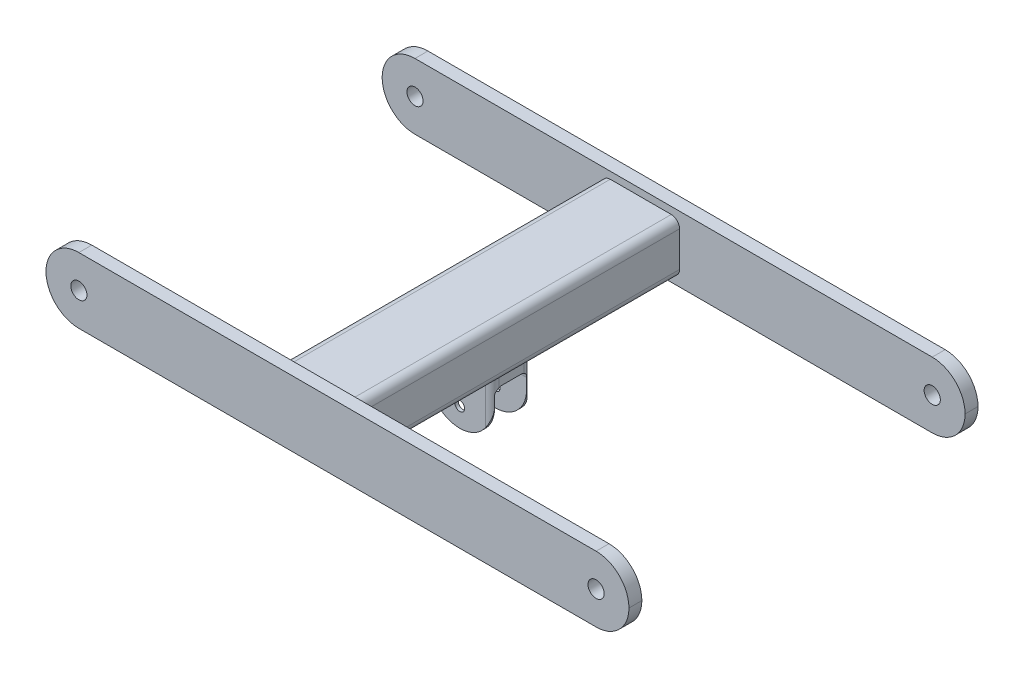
ISO-10303-21;
HEADER;
FILE_DESCRIPTION(('STEP AP214'),'2;1');
FILE_NAME('part.step','',(''),(''),'','','');
FILE_SCHEMA(('AUTOMOTIVE_DESIGN { 1 0 10303 214 1 1 1 1 }'));
ENDSEC;
DATA;
#1=APPLICATION_CONTEXT('core data for automotive mechanical design processes');
#2=APPLICATION_PROTOCOL_DEFINITION('international standard','automotive_design',2000,#1);
#3=PRODUCT_CONTEXT('',#1,'mechanical');
#4=PRODUCT('Part','Part','',(#3));
#5=PRODUCT_RELATED_PRODUCT_CATEGORY('part','',(#4));
#6=PRODUCT_DEFINITION_FORMATION('','',#4);
#7=PRODUCT_DEFINITION_CONTEXT('part definition',#1,'design');
#8=PRODUCT_DEFINITION('design','',#6,#7);
#9=PRODUCT_DEFINITION_SHAPE('','',#8);
#10=(LENGTH_UNIT() NAMED_UNIT(*) SI_UNIT(.MILLI.,.METRE.));
#11=(NAMED_UNIT(*) PLANE_ANGLE_UNIT() SI_UNIT($,.RADIAN.));
#12=(NAMED_UNIT(*) SI_UNIT($,.STERADIAN.) SOLID_ANGLE_UNIT());
#13=UNCERTAINTY_MEASURE_WITH_UNIT(LENGTH_MEASURE(1.E-05),#10,'distance_accuracy_value','');
#14=(GEOMETRIC_REPRESENTATION_CONTEXT(3) GLOBAL_UNCERTAINTY_ASSIGNED_CONTEXT((#13)) GLOBAL_UNIT_ASSIGNED_CONTEXT((#10,
#11,#12)) REPRESENTATION_CONTEXT('',''));
#15=CARTESIAN_POINT('',(0.,0.,0.));
#16=DIRECTION('',(0.,0.,1.));
#17=DIRECTION('',(1.,0.,0.));
#18=AXIS2_PLACEMENT_3D('',#15,#16,#17);
#19=CARTESIAN_POINT('',(180.238,-65.,9.79999999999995));
#20=DIRECTION('',(0.,1.,0.));
#21=DIRECTION('',(0.,0.,1.));
#22=AXIS2_PLACEMENT_3D('',#19,#20,#21);
#23=CYLINDRICAL_SURFACE('',#22,5.20000000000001);
#24=DIRECTION('',(0.,1.,0.));
#25=VECTOR('',#24,1.);
#26=CARTESIAN_POINT('',(175.734667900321,-65.,12.3999999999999));
#27=LINE('',#26,#25);
#28=CARTESIAN_POINT('',(175.734667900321,-32.5,12.3999999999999));
#29=VERTEX_POINT('',#28);
#30=CARTESIAN_POINT('',(175.734667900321,-40.6966679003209,12.3999999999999));
#31=VERTEX_POINT('',#30);
#32=EDGE_CURVE('E581',#29,#31,#27,.F.);
#33=ORIENTED_EDGE('',*,*,#32,.T.);
#34=CARTESIAN_POINT('',(175.734667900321,-40.6966679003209,12.4000000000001));
#35=CARTESIAN_POINT('',(175.734663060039,-40.884821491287,12.3999479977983));
#36=CARTESIAN_POINT('',(175.73685269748,-41.072959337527,12.4037835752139));
#37=CARTESIAN_POINT('',(175.74558268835,-41.4487747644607,12.4188398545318));
#38=CARTESIAN_POINT('',(175.75212151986,-41.6364524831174,12.4300579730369));
#39=CARTESIAN_POINT('',(175.76948566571,-42.0104900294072,12.4594457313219));
#40=CARTESIAN_POINT('',(175.78029808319,-42.1968521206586,12.4775944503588));
#41=CARTESIAN_POINT('',(175.806147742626,-42.5685662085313,12.5201668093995));
#42=CARTESIAN_POINT('',(175.821185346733,-42.7539181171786,12.5445909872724));
#43=CARTESIAN_POINT('',(175.872583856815,-43.3086940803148,12.626177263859));
#44=CARTESIAN_POINT('',(175.915207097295,-43.6763411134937,12.6916101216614));
#45=CARTESIAN_POINT('',(176.016658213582,-44.4065462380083,12.837788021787));
#46=CARTESIAN_POINT('',(176.075501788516,-44.7690990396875,12.9185478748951));
#47=CARTESIAN_POINT('',(176.205753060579,-45.4712966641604,13.085058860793));
#48=CARTESIAN_POINT('',(176.276398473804,-45.811189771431,13.170367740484));
#49=CARTESIAN_POINT('',(176.431905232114,-46.4866933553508,13.3450421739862));
#50=CARTESIAN_POINT('',(176.516768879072,-46.8223031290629,13.4344083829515));
#51=CARTESIAN_POINT('',(176.700756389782,-47.4896684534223,13.6137151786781));
#52=CARTESIAN_POINT('',(176.799888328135,-47.8214217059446,13.703656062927));
#53=CARTESIAN_POINT('',(177.012442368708,-48.4809954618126,13.8810487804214));
#54=CARTESIAN_POINT('',(177.12586642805,-48.8088154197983,13.9685002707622));
#55=CARTESIAN_POINT('',(177.486733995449,-49.7835174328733,14.2223022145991));
#56=CARTESIAN_POINT('',(177.755641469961,-50.4247983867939,14.3810011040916));
#57=CARTESIAN_POINT('',(178.202205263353,-51.3724249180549,14.5877366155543));
#58=CARTESIAN_POINT('',(178.358165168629,-51.6857538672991,14.6514039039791));
#59=CARTESIAN_POINT('',(178.684539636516,-52.3072126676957,14.765544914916));
#60=CARTESIAN_POINT('',(178.854948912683,-52.6153443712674,14.8160234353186));
#61=CARTESIAN_POINT('',(179.125177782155,-53.0797129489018,14.8804232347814));
#62=CARTESIAN_POINT('',(179.219815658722,-53.2381712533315,14.9002868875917));
#63=CARTESIAN_POINT('',(179.412917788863,-53.5532641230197,14.9350620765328));
#64=CARTESIAN_POINT('',(179.511381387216,-53.709898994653,14.9499744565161));
#65=CARTESIAN_POINT('',(179.712391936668,-54.0216861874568,14.9743622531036));
#66=CARTESIAN_POINT('',(179.814951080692,-54.1768320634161,14.9838199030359));
#67=CARTESIAN_POINT('',(180.02375198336,-54.4849422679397,14.99663541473));
#68=CARTESIAN_POINT('',(180.129994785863,-54.6379059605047,14.9999915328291));
#69=CARTESIAN_POINT('',(180.238,-54.7896431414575,15.));
#70=B_SPLINE_CURVE_WITH_KNOTS('',3,(#34,#35,#36,#37,#38,#39,#40,#41,#42,#43,#44,#45,#46,#47,#48,
#49,#50,#51,#52,#53,#54,#55,#56,#57,#58,#59,#60,#61,#62,#63,#64,#65,#66,#67,#68,#69),
.UNSPECIFIED.,.F.,.F.,(4,2,2,2,2,2,2,2,2,2,2,2,2,2,2,2,2,4),(0.,0.564383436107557,
1.12856948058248,1.69106576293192,2.25361027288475,3.3801941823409,4.50787232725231,
5.57996490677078,6.65223122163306,7.72510674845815,8.79812935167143,10.9340170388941,
12.0008181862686,13.0672307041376,13.624039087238,14.1807525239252,14.7392691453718,
15.2979453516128),.UNSPECIFIED.);
#71=CARTESIAN_POINT('',(180.238,-54.7896431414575,14.9999999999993));
#72=VERTEX_POINT('',#71);
#73=EDGE_CURVE('E411',#31,#72,#70,.T.);
#74=ORIENTED_EDGE('',*,*,#73,.T.);
#75=DIRECTION('',(0.,1.,0.));
#76=VECTOR('',#75,1.);
#77=CARTESIAN_POINT('',(180.238,-65.,15.));
#78=LINE('',#77,#76);
#79=CARTESIAN_POINT('',(180.238,0.,15.));
#80=VERTEX_POINT('',#79);
#81=EDGE_CURVE('E316',#72,#80,#78,.T.);
#82=ORIENTED_EDGE('',*,*,#81,.T.);
#83=CARTESIAN_POINT('',(180.238,0.,9.79999999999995));
#84=DIRECTION('',(0.,-1.,0.));
#85=DIRECTION('',(1.,0.,0.));
#86=AXIS2_PLACEMENT_3D('',#83,#84,#85);
#87=CIRCLE('',#86,5.20000000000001);
#88=CARTESIAN_POINT('',(175.038,0.,9.79999999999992));
#89=VERTEX_POINT('',#88);
#90=EDGE_CURVE('E505',#80,#89,#87,.T.);
#91=ORIENTED_EDGE('',*,*,#90,.T.);
#92=DIRECTION('',(0.,1.,0.));
#93=VECTOR('',#92,1.);
#94=CARTESIAN_POINT('',(175.038,-65.,9.79999999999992));
#95=LINE('',#94,#93);
#96=CARTESIAN_POINT('',(175.038,-28.1136575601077,9.79999999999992));
#97=VERTEX_POINT('',#96);
#98=EDGE_CURVE('E292',#97,#89,#95,.T.);
#99=ORIENTED_EDGE('',*,*,#98,.F.);
#100=CARTESIAN_POINT('',(175.038,-28.1136575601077,9.79999999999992));
#101=CARTESIAN_POINT('',(175.037984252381,-28.1777257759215,9.91714518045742));
#102=CARTESIAN_POINT('',(175.041957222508,-28.2464901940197,10.0316305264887));
#103=CARTESIAN_POINT('',(175.056688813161,-28.3926262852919,10.2543176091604));
#104=CARTESIAN_POINT('',(175.067438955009,-28.4699871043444,10.3625270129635));
#105=CARTESIAN_POINT('',(175.094454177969,-28.632185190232,10.571339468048));
#106=CARTESIAN_POINT('',(175.110684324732,-28.7169726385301,10.6719858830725));
#107=CARTESIAN_POINT('',(175.147453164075,-28.8937583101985,10.8658700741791));
#108=CARTESIAN_POINT('',(175.167993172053,-28.9857587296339,10.959105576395));
#109=CARTESIAN_POINT('',(175.234063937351,-29.2708336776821,11.2262231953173));
#110=CARTESIAN_POINT('',(175.284215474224,-29.4738598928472,11.3886396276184));
#111=CARTESIAN_POINT('',(175.361477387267,-29.7949401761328,11.6070817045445));
#112=CARTESIAN_POINT('',(175.387615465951,-29.904919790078,11.675791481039));
#113=CARTESIAN_POINT('',(175.439394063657,-30.1300201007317,11.8045413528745));
#114=CARTESIAN_POINT('',(175.465034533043,-30.2451413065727,11.8645805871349));
#115=CARTESIAN_POINT('',(175.517094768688,-30.4917096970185,11.9811769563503));
#116=CARTESIAN_POINT('',(175.543337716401,-30.6236408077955,12.036791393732));
#117=CARTESIAN_POINT('',(175.592235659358,-30.8923292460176,12.1366570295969));
#118=CARTESIAN_POINT('',(175.614892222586,-31.0290844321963,12.1809131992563));
#119=CARTESIAN_POINT('',(175.655153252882,-31.3062064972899,12.257516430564));
#120=CARTESIAN_POINT('',(175.672771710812,-31.4465621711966,12.2898965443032));
#121=CARTESIAN_POINT('',(175.701838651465,-31.7300945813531,12.3424693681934));
#122=CARTESIAN_POINT('',(175.713291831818,-31.8732690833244,12.3626713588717));
#123=CARTESIAN_POINT('',(175.7256967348,-32.0973654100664,12.3844136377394));
#124=CARTESIAN_POINT('',(175.729052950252,-32.1777632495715,12.3902564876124));
#125=CARTESIAN_POINT('',(175.733541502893,-32.3387693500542,12.398049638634));
#126=CARTESIAN_POINT('',(175.734674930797,-32.4193774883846,12.4000018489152));
#127=CARTESIAN_POINT('',(175.734667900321,-32.5,12.3999999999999));
#128=B_SPLINE_CURVE_WITH_KNOTS('',3,(#100,#101,#102,#103,#104,#105,#106,#107,#108,#109,#110,
#111,#112,#113,#114,#115,#116,#117,#118,#119,#120,#121,#122,#123,#124,#125,#126,#127),
.UNSPECIFIED.,.F.,.F.,(4,2,2,2,2,2,2,2,2,2,2,2,2,4),(0.,0.400276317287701,0.800052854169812,
1.19732752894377,1.59472363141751,2.38525773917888,2.78184122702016,3.17846407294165,
3.61459778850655,4.0505402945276,4.48526015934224,4.91964831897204,5.16157517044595,
5.40338327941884),.UNSPECIFIED.);
#129=EDGE_CURVE('E341',#97,#29,#128,.T.);
#130=ORIENTED_EDGE('',*,*,#129,.T.);
#131=EDGE_LOOP('',(#33,#74,#82,#91,#99,#130));
#132=FACE_BOUND('',#131,.T.);
#133=ADVANCED_FACE('F102',(#132),#23,.T.);
#134=CARTESIAN_POINT('',(175.038,-65.,9.79999999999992));
#135=DIRECTION('',(1.,0.,0.));
#136=DIRECTION('',(0.,0.,-1.));
#137=AXIS2_PLACEMENT_3D('',#134,#135,#136);
#138=PLANE('',#137);
#139=DIRECTION('',(0.,1.,0.));
#140=VECTOR('',#139,1.);
#141=CARTESIAN_POINT('',(175.038,-65.,-9.80000000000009));
#142=LINE('',#141,#140);
#143=CARTESIAN_POINT('',(175.038,-28.1136575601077,-9.80000000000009));
#144=VERTEX_POINT('',#143);
#145=CARTESIAN_POINT('',(175.038,0.,-9.80000000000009));
#146=VERTEX_POINT('',#145);
#147=EDGE_CURVE('E290',#144,#146,#142,.T.);
#148=ORIENTED_EDGE('',*,*,#147,.F.);
#149=CARTESIAN_POINT('',(175.038,-32.5,-7.40000000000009));
#150=DIRECTION('',(1.,0.,0.));
#151=DIRECTION('',(0.,0.,-1.));
#152=AXIS2_PLACEMENT_3D('',#149,#150,#151);
#153=CIRCLE('',#152,5.);
#154=CARTESIAN_POINT('',(175.038,-27.5,-7.4000000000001));
#155=VERTEX_POINT('',#154);
#156=EDGE_CURVE('E458',#144,#155,#153,.T.);
#157=ORIENTED_EDGE('',*,*,#156,.T.);
#158=DIRECTION('',(0.,0.,-1.));
#159=VECTOR('',#158,1.);
#160=CARTESIAN_POINT('',(175.038,-27.5,12.3999999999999));
#161=LINE('',#160,#159);
#162=CARTESIAN_POINT('',(175.038,-27.5,7.39999999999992));
#163=VERTEX_POINT('',#162);
#164=EDGE_CURVE('E573',#163,#155,#161,.T.);
#165=ORIENTED_EDGE('',*,*,#164,.F.);
#166=CARTESIAN_POINT('',(175.038,-32.5,7.39999999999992));
#167=DIRECTION('',(1.,0.,0.));
#168=DIRECTION('',(0.,0.,-1.));
#169=AXIS2_PLACEMENT_3D('',#166,#167,#168);
#170=CIRCLE('',#169,5.);
#171=EDGE_CURVE('E338',#163,#97,#170,.T.);
#172=ORIENTED_EDGE('',*,*,#171,.T.);
#173=ORIENTED_EDGE('',*,*,#98,.T.);
#174=DIRECTION('',(0.,0.,-1.));
#175=VECTOR('',#174,1.);
#176=CARTESIAN_POINT('',(175.038,0.,9.79999999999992));
#177=LINE('',#176,#175);
#178=EDGE_CURVE('E474',#89,#146,#177,.T.);
#179=ORIENTED_EDGE('',*,*,#178,.T.);
#180=EDGE_LOOP('',(#148,#157,#165,#172,#173,#179));
#181=FACE_BOUND('',#180,.T.);
#182=ADVANCED_FACE('F461',(#181),#138,.F.);
#183=CARTESIAN_POINT('',(180.238,-65.,-9.80000000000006));
#184=DIRECTION('',(0.,1.,0.));
#185=DIRECTION('',(0.,0.,1.));
#186=AXIS2_PLACEMENT_3D('',#183,#184,#185);
#187=CYLINDRICAL_SURFACE('',#186,5.20000000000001);
#188=DIRECTION('',(0.,1.,0.));
#189=VECTOR('',#188,1.);
#190=CARTESIAN_POINT('',(180.238,-65.,-15.0000000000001));
#191=LINE('',#190,#189);
#192=CARTESIAN_POINT('',(180.238,-54.7896431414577,-15.0000000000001));
#193=VERTEX_POINT('',#192);
#194=CARTESIAN_POINT('',(180.238,0.,-15.0000000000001));
#195=VERTEX_POINT('',#194);
#196=EDGE_CURVE('E272',#193,#195,#191,.T.);
#197=ORIENTED_EDGE('',*,*,#196,.F.);
#198=CARTESIAN_POINT('',(180.238,-54.7896431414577,-15.0000000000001));
#199=CARTESIAN_POINT('',(180.11465506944,-54.6163576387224,-14.9999857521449));
#200=CARTESIAN_POINT('',(179.993614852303,-54.4414779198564,-14.9956120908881));
#201=CARTESIAN_POINT('',(179.756366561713,-54.0889179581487,-14.9790154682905));
#202=CARTESIAN_POINT('',(179.640156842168,-53.911238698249,-14.9667952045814));
#203=CARTESIAN_POINT('',(179.412899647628,-53.553650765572,-14.9354002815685));
#204=CARTESIAN_POINT('',(179.301843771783,-53.3737463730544,-14.9162374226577));
#205=CARTESIAN_POINT('',(179.084781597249,-53.0116651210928,-14.8717218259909));
#206=CARTESIAN_POINT('',(178.978775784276,-52.8294880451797,-14.8463684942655));
#207=CARTESIAN_POINT('',(178.668420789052,-52.2798477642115,-14.7620971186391));
#208=CARTESIAN_POINT('',(178.471731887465,-51.9092720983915,-14.6949673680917));
#209=CARTESIAN_POINT('',(178.098987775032,-51.1612034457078,-14.543952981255));
#210=CARTESIAN_POINT('',(177.922941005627,-50.7837077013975,-14.4600615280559));
#211=CARTESIAN_POINT('',(177.479915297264,-49.7667671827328,-14.2195409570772));
#212=CARTESIAN_POINT('',(177.231350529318,-49.1217985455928,-14.0519218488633));
#213=CARTESIAN_POINT('',(176.900840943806,-48.1426560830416,-13.7903873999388));
#214=CARTESIAN_POINT('',(176.797656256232,-47.8140368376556,-13.7014433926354));
#215=CARTESIAN_POINT('',(176.60536780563,-47.1528438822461,-13.5230573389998));
#216=CARTESIAN_POINT('',(176.51626210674,-46.8202707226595,-13.4336153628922));
#217=CARTESIAN_POINT('',(176.352632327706,-46.1530906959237,-13.2580660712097));
#218=CARTESIAN_POINT('',(176.278018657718,-45.8185104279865,-13.1719410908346));
#219=CARTESIAN_POINT('',(176.142730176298,-45.1448222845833,-13.0062751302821));
#220=CARTESIAN_POINT('',(176.082058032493,-44.8057135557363,-12.9267354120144));
#221=CARTESIAN_POINT('',(175.97502441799,-44.1236266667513,-12.7791492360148));
#222=CARTESIAN_POINT('',(175.92862777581,-43.7806602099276,-12.7110747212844));
#223=CARTESIAN_POINT('',(175.850334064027,-43.0902580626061,-12.5916901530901));
#224=CARTESIAN_POINT('',(175.818427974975,-42.742825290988,-12.5403696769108));
#225=CARTESIAN_POINT('',(175.78416013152,-42.2532738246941,-12.4839630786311));
#226=CARTESIAN_POINT('',(175.77554076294,-42.1126243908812,-12.4695814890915));
#227=CARTESIAN_POINT('',(175.760736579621,-41.8308347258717,-12.4446784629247));
#228=CARTESIAN_POINT('',(175.754552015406,-41.6896944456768,-12.4341574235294));
#229=CARTESIAN_POINT('',(175.744627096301,-41.4066613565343,-12.4171935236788));
#230=CARTESIAN_POINT('',(175.740894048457,-41.264767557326,-12.4107628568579));
#231=CARTESIAN_POINT('',(175.735913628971,-40.9808065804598,-12.4021573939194));
#232=CARTESIAN_POINT('',(175.734666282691,-40.8387394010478,-12.3999826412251));
#233=CARTESIAN_POINT('',(175.734667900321,-40.6966679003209,-12.4000000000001));
#234=B_SPLINE_CURVE_WITH_KNOTS('',3,(#198,#199,#200,#201,#202,#203,#204,#205,#206,#207,#208,
#209,#210,#211,#212,#213,#214,#215,#216,#217,#218,#219,#220,#221,#222,#223,#224,#225,#226,#227,
#228,#229,#230,#231,#232,#233),.UNSPECIFIED.,.F.,.F.,(4,2,2,2,2,2,2,2,2,2,2,2,2,2,2,2,2,4),(0.,
0.637985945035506,1.27575267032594,1.9124404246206,2.54918929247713,3.8226749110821,
5.09667950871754,7.22699606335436,8.29400727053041,9.36087163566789,10.4209146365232,
11.4811603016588,12.53877245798,13.5957254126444,14.0206017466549,14.445521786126,
14.8717026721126,15.2978879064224),.UNSPECIFIED.);
#235=CARTESIAN_POINT('',(175.734667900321,-40.6966679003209,-12.3999999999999));
#236=VERTEX_POINT('',#235);
#237=EDGE_CURVE('E277',#193,#236,#234,.T.);
#238=ORIENTED_EDGE('',*,*,#237,.T.);
#239=DIRECTION('',(0.,1.,0.));
#240=VECTOR('',#239,1.);
#241=CARTESIAN_POINT('',(175.734667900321,-65.,-12.4000000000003));
#242=LINE('',#241,#240);
#243=CARTESIAN_POINT('',(175.734667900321,-32.5,-12.4000000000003));
#244=VERTEX_POINT('',#243);
#245=EDGE_CURVE('E476',#236,#244,#242,.T.);
#246=ORIENTED_EDGE('',*,*,#245,.T.);
#247=CARTESIAN_POINT('',(175.734667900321,-32.5,-12.4000000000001));
#248=CARTESIAN_POINT('',(175.734733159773,-32.3663123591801,-12.4000242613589));
#249=CARTESIAN_POINT('',(175.731573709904,-32.2326569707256,-12.3946391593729));
#250=CARTESIAN_POINT('',(175.719298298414,-31.9665855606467,-12.373248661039));
#251=CARTESIAN_POINT('',(175.71018745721,-31.8341685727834,-12.3572523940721));
#252=CARTESIAN_POINT('',(175.686579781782,-31.572393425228,-12.3149791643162));
#253=CARTESIAN_POINT('',(175.672119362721,-31.4430207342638,-12.2887716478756));
#254=CARTESIAN_POINT('',(175.638674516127,-31.1873225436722,-12.2264085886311));
#255=CARTESIAN_POINT('',(175.619689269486,-31.060997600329,-12.1902512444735));
#256=CARTESIAN_POINT('',(175.557567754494,-30.6884583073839,-12.0675905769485));
#257=CARTESIAN_POINT('',(175.50915720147,-30.44763353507,-11.9667264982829));
#258=CARTESIAN_POINT('',(175.432914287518,-30.1009416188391,-11.7887968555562));
#259=CARTESIAN_POINT('',(175.406844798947,-29.9876093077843,-11.7249076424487));
#260=CARTESIAN_POINT('',(175.354691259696,-29.7662146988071,-11.5884722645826));
#261=CARTESIAN_POINT('',(175.328607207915,-29.6581528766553,-11.5159253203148));
#262=CARTESIAN_POINT('',(175.27535123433,-29.4383997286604,-11.3555954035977));
#263=CARTESIAN_POINT('',(175.24829154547,-29.3272520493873,-11.267029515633));
#264=CARTESIAN_POINT('',(175.197175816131,-29.1125512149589,-11.0804083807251));
#265=CARTESIAN_POINT('',(175.173118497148,-29.0089948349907,-10.9823572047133));
#266=CARTESIAN_POINT('',(175.129642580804,-28.81049981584,-10.7775525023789));
#267=CARTESIAN_POINT('',(175.110209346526,-28.7155345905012,-10.6708279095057));
#268=CARTESIAN_POINT('',(175.077459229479,-28.5347376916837,-10.4491183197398));
#269=CARTESIAN_POINT('',(175.06413725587,-28.448898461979,-10.3341402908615));
#270=CARTESIAN_POINT('',(175.049251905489,-28.3223702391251,-10.1484534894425));
#271=CARTESIAN_POINT('',(175.045094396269,-28.2782826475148,-10.0802420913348));
#272=CARTESIAN_POINT('',(175.039467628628,-28.1934380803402,-9.94167830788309));
#273=CARTESIAN_POINT('',(175.037998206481,-28.1526809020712,-9.87132605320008));
#274=CARTESIAN_POINT('',(175.038,-28.1136575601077,-9.80000000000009));
#275=B_SPLINE_CURVE_WITH_KNOTS('',3,(#247,#248,#249,#250,#251,#252,#253,#254,#255,#256,#257,
#258,#259,#260,#261,#262,#263,#264,#265,#266,#267,#268,#269,#270,#271,#272,#273,#274),
.UNSPECIFIED.,.F.,.F.,(4,2,2,2,2,2,2,2,2,2,2,2,2,4),(0.,0.400864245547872,0.801384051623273,
1.19922619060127,1.5971404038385,2.3898099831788,2.78759245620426,3.1854107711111,
3.61890677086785,4.05221753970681,4.48413791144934,4.91569782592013,5.15954633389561,
5.40337998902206),.UNSPECIFIED.);
#276=EDGE_CURVE('E450',#244,#144,#275,.T.);
#277=ORIENTED_EDGE('',*,*,#276,.T.);
#278=ORIENTED_EDGE('',*,*,#147,.T.);
#279=CARTESIAN_POINT('',(180.238,0.,-9.80000000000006));
#280=DIRECTION('',(0.,-1.,0.));
#281=DIRECTION('',(1.,0.,0.));
#282=AXIS2_PLACEMENT_3D('',#279,#280,#281);
#283=CIRCLE('',#282,5.20000000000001);
#284=EDGE_CURVE('E288',#146,#195,#283,.T.);
#285=ORIENTED_EDGE('',*,*,#284,.T.);
#286=EDGE_LOOP('',(#197,#238,#246,#277,#278,#285));
#287=FACE_BOUND('',#286,.T.);
#288=ADVANCED_FACE('F286',(#287),#187,.T.);
#289=CARTESIAN_POINT('',(219.838,-65.,-14.9999999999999));
#290=DIRECTION('',(0.,0.,1.));
#291=DIRECTION('',(1.,0.,0.));
#292=AXIS2_PLACEMENT_3D('',#289,#290,#291);
#293=PLANE('',#292);
#294=CARTESIAN_POINT('',(200.038,-50.,-15.));
#295=DIRECTION('',(0.,0.,1.));
#296=DIRECTION('',(1.,0.,0.));
#297=AXIS2_PLACEMENT_3D('',#294,#295,#296);
#298=CIRCLE('',#297,3.75);
#299=CARTESIAN_POINT('',(203.788,-50.,-15.));
#300=VERTEX_POINT('',#299);
#301=EDGE_CURVE('E627',#300,#300,#298,.T.);
#302=ORIENTED_EDGE('',*,*,#301,.T.);
#303=EDGE_LOOP('',(#302));
#304=FACE_BOUND('',#303,.T.);
#305=DIRECTION('',(0.,1.,0.));
#306=VECTOR('',#305,1.);
#307=CARTESIAN_POINT('',(219.838,-65.,-14.9999999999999));
#308=LINE('',#307,#306);
#309=CARTESIAN_POINT('',(219.838,-54.7896431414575,-14.9999999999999));
#310=VERTEX_POINT('',#309);
#311=CARTESIAN_POINT('',(219.838,0.,-14.9999999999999));
#312=VERTEX_POINT('',#311);
#313=EDGE_CURVE('E274',#310,#312,#308,.T.);
#314=ORIENTED_EDGE('',*,*,#313,.F.);
#315=CARTESIAN_POINT('',(200.038,-40.6966679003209,-15.));
#316=DIRECTION('',(0.,0.,1.));
#317=DIRECTION('',(1.,0.,0.));
#318=AXIS2_PLACEMENT_3D('',#315,#316,#317);
#319=CIRCLE('',#318,24.3033320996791);
#320=EDGE_CURVE('E267',#193,#310,#319,.T.);
#321=ORIENTED_EDGE('',*,*,#320,.F.);
#322=ORIENTED_EDGE('',*,*,#196,.T.);
#323=DIRECTION('',(1.,0.,0.));
#324=VECTOR('',#323,1.);
#325=CARTESIAN_POINT('',(219.838,0.,-14.9999999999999));
#326=LINE('',#325,#324);
#327=EDGE_CURVE('E516',#195,#312,#326,.T.);
#328=ORIENTED_EDGE('',*,*,#327,.T.);
#329=EDGE_LOOP('',(#314,#321,#322,#328));
#330=FACE_BOUND('',#329,.T.);
#331=ADVANCED_FACE('F269',(#304,#330),#293,.F.);
#332=CARTESIAN_POINT('',(219.838,-65.,-9.79999999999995));
#333=DIRECTION('',(0.,1.,0.));
#334=DIRECTION('',(0.,0.,1.));
#335=AXIS2_PLACEMENT_3D('',#332,#333,#334);
#336=CYLINDRICAL_SURFACE('',#335,5.19999999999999);
#337=DIRECTION('',(0.,1.,0.));
#338=VECTOR('',#337,1.);
#339=CARTESIAN_POINT('',(224.341332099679,-65.,-12.4000000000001));
#340=LINE('',#339,#338);
#341=CARTESIAN_POINT('',(224.341332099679,-32.5,-12.4000000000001));
#342=VERTEX_POINT('',#341);
#343=CARTESIAN_POINT('',(224.341332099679,-40.6966679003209,-12.3999999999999));
#344=VERTEX_POINT('',#343);
#345=EDGE_CURVE('E574',#342,#344,#340,.F.);
#346=ORIENTED_EDGE('',*,*,#345,.T.);
#347=CARTESIAN_POINT('',(224.341332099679,-40.6966679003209,-12.4));
#348=CARTESIAN_POINT('',(224.341336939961,-40.884821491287,-12.3999479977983));
#349=CARTESIAN_POINT('',(224.33914730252,-41.072959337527,-12.4037835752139));
#350=CARTESIAN_POINT('',(224.33041731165,-41.4487747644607,-12.4188398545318));
#351=CARTESIAN_POINT('',(224.32387848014,-41.6364524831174,-12.4300579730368));
#352=CARTESIAN_POINT('',(224.30651433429,-42.0104900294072,-12.4594457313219));
#353=CARTESIAN_POINT('',(224.29570191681,-42.1968521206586,-12.4775944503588));
#354=CARTESIAN_POINT('',(224.269852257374,-42.5685662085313,-12.5201668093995));
#355=CARTESIAN_POINT('',(224.254814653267,-42.7539181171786,-12.5445909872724));
#356=CARTESIAN_POINT('',(224.203416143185,-43.3086940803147,-12.6261772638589));
#357=CARTESIAN_POINT('',(224.160792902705,-43.6763411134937,-12.6916101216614));
#358=CARTESIAN_POINT('',(224.059341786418,-44.4065462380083,-12.8377880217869));
#359=CARTESIAN_POINT('',(224.000498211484,-44.7690990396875,-12.9185478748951));
#360=CARTESIAN_POINT('',(223.870246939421,-45.4712966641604,-13.0850588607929));
#361=CARTESIAN_POINT('',(223.799601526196,-45.811189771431,-13.170367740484));
#362=CARTESIAN_POINT('',(223.644094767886,-46.4866933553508,-13.3450421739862));
#363=CARTESIAN_POINT('',(223.559231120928,-46.8223031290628,-13.4344083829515));
#364=CARTESIAN_POINT('',(223.375243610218,-47.4896684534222,-13.6137151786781));
#365=CARTESIAN_POINT('',(223.276111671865,-47.8214217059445,-13.7036560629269));
#366=CARTESIAN_POINT('',(223.063557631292,-48.4809954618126,-13.8810487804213));
#367=CARTESIAN_POINT('',(222.95013357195,-48.8088154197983,-13.9685002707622));
#368=CARTESIAN_POINT('',(222.589266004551,-49.7835174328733,-14.2223022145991));
#369=CARTESIAN_POINT('',(222.320358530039,-50.4247983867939,-14.3810011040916));
#370=CARTESIAN_POINT('',(221.873794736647,-51.3724249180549,-14.5877366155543));
#371=CARTESIAN_POINT('',(221.717834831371,-51.6857538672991,-14.6514039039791));
#372=CARTESIAN_POINT('',(221.391460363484,-52.3072126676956,-14.7655449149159));
#373=CARTESIAN_POINT('',(221.221051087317,-52.6153443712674,-14.8160234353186));
#374=CARTESIAN_POINT('',(220.950822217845,-53.0797129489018,-14.8804232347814));
#375=CARTESIAN_POINT('',(220.856184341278,-53.2381712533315,-14.9002868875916));
#376=CARTESIAN_POINT('',(220.663082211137,-53.5532641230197,-14.9350620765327));
#377=CARTESIAN_POINT('',(220.564618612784,-53.709898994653,-14.9499744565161));
#378=CARTESIAN_POINT('',(220.363608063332,-54.0216861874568,-14.9743622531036));
#379=CARTESIAN_POINT('',(220.261048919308,-54.1768320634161,-14.9838199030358));
#380=CARTESIAN_POINT('',(220.05224801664,-54.4849422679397,-14.99663541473));
#381=CARTESIAN_POINT('',(219.946005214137,-54.6379059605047,-14.9999915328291));
#382=CARTESIAN_POINT('',(219.838,-54.7896431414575,-14.9999999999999));
#383=B_SPLINE_CURVE_WITH_KNOTS('',3,(#347,#348,#349,#350,#351,#352,#353,#354,#355,#356,#357,
#358,#359,#360,#361,#362,#363,#364,#365,#366,#367,#368,#369,#370,#371,#372,#373,#374,#375,#376,
#377,#378,#379,#380,#381,#382),.UNSPECIFIED.,.F.,.F.,(4,2,2,2,2,2,2,2,2,2,2,2,2,2,2,2,2,4),(0.,
0.564383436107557,1.12856948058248,1.69106576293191,2.25361027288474,3.38019418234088,
4.50787232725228,5.57996490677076,6.65223122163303,7.7251067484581,8.79812935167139,
10.9340170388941,12.0008181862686,13.0672307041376,13.624039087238,14.1807525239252,
14.7392691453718,15.2979453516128),.UNSPECIFIED.);
#384=EDGE_CURVE('E433',#344,#310,#383,.T.);
#385=ORIENTED_EDGE('',*,*,#384,.T.);
#386=ORIENTED_EDGE('',*,*,#313,.T.);
#387=CARTESIAN_POINT('',(219.838,0.,-9.79999999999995));
#388=DIRECTION('',(0.,-1.,0.));
#389=DIRECTION('',(1.,0.,0.));
#390=AXIS2_PLACEMENT_3D('',#387,#388,#389);
#391=CIRCLE('',#390,5.19999999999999);
#392=CARTESIAN_POINT('',(225.038,0.,-9.79999999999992));
#393=VERTEX_POINT('',#392);
#394=EDGE_CURVE('E518',#312,#393,#391,.T.);
#395=ORIENTED_EDGE('',*,*,#394,.T.);
#396=DIRECTION('',(0.,1.,0.));
#397=VECTOR('',#396,1.);
#398=CARTESIAN_POINT('',(225.038,-65.,-9.79999999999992));
#399=LINE('',#398,#397);
#400=CARTESIAN_POINT('',(225.038,-28.1136575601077,-9.79999999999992));
#401=VERTEX_POINT('',#400);
#402=EDGE_CURVE('E294',#401,#393,#399,.T.);
#403=ORIENTED_EDGE('',*,*,#402,.F.);
#404=CARTESIAN_POINT('',(225.038,-28.1136575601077,-9.79999999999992));
#405=CARTESIAN_POINT('',(225.038015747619,-28.1777257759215,-9.91714518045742));
#406=CARTESIAN_POINT('',(225.034042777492,-28.2464901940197,-10.0316305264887));
#407=CARTESIAN_POINT('',(225.019311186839,-28.3926262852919,-10.2543176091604));
#408=CARTESIAN_POINT('',(225.008561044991,-28.4699871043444,-10.3625270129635));
#409=CARTESIAN_POINT('',(224.981545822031,-28.632185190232,-10.571339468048));
#410=CARTESIAN_POINT('',(224.965315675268,-28.7169726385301,-10.6719858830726));
#411=CARTESIAN_POINT('',(224.928546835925,-28.8937583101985,-10.8658700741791));
#412=CARTESIAN_POINT('',(224.908006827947,-28.9857587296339,-10.959105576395));
#413=CARTESIAN_POINT('',(224.841936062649,-29.2708336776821,-11.2262231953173));
#414=CARTESIAN_POINT('',(224.791784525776,-29.4738598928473,-11.3886396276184));
#415=CARTESIAN_POINT('',(224.714522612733,-29.7949401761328,-11.6070817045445));
#416=CARTESIAN_POINT('',(224.688384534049,-29.904919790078,-11.675791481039));
#417=CARTESIAN_POINT('',(224.636605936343,-30.1300201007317,-11.8045413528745));
#418=CARTESIAN_POINT('',(224.610965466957,-30.2451413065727,-11.8645805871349));
#419=CARTESIAN_POINT('',(224.558905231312,-30.4917096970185,-11.9811769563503));
#420=CARTESIAN_POINT('',(224.532662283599,-30.6236408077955,-12.036791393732));
#421=CARTESIAN_POINT('',(224.483764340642,-30.8923292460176,-12.1366570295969));
#422=CARTESIAN_POINT('',(224.461107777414,-31.0290844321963,-12.1809131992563));
#423=CARTESIAN_POINT('',(224.420846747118,-31.3062064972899,-12.257516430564));
#424=CARTESIAN_POINT('',(224.403228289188,-31.4465621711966,-12.2898965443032));
#425=CARTESIAN_POINT('',(224.374161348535,-31.7300945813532,-12.3424693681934));
#426=CARTESIAN_POINT('',(224.362708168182,-31.8732690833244,-12.3626713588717));
#427=CARTESIAN_POINT('',(224.3503032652,-32.0973654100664,-12.3844136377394));
#428=CARTESIAN_POINT('',(224.346947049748,-32.1777632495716,-12.3902564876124));
#429=CARTESIAN_POINT('',(224.342458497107,-32.3387693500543,-12.398049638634));
#430=CARTESIAN_POINT('',(224.341325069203,-32.4193774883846,-12.4000018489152));
#431=CARTESIAN_POINT('',(224.341332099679,-32.5,-12.3999999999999));
#432=B_SPLINE_CURVE_WITH_KNOTS('',3,(#404,#405,#406,#407,#408,#409,#410,#411,#412,#413,#414,
#415,#416,#417,#418,#419,#420,#421,#422,#423,#424,#425,#426,#427,#428,#429,#430,#431),
.UNSPECIFIED.,.F.,.F.,(4,2,2,2,2,2,2,2,2,2,2,2,2,4),(0.,0.400276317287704,0.800052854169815,
1.19732752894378,1.59472363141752,2.3852577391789,2.78184122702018,3.17846407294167,
3.61459778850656,4.05054029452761,4.48526015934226,4.91964831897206,5.16157517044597,
5.40338327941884),.UNSPECIFIED.);
#433=EDGE_CURVE('E444',#401,#342,#432,.T.);
#434=ORIENTED_EDGE('',*,*,#433,.T.);
#435=EDGE_LOOP('',(#346,#385,#386,#395,#403,#434));
#436=FACE_BOUND('',#435,.T.);
#437=ADVANCED_FACE('F437',(#436),#336,.T.);
#438=CARTESIAN_POINT('',(225.038,-65.,-9.79999999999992));
#439=DIRECTION('',(-1.,0.,0.));
#440=DIRECTION('',(0.,0.,1.));
#441=AXIS2_PLACEMENT_3D('',#438,#439,#440);
#442=PLANE('',#441);
#443=DIRECTION('',(0.,1.,0.));
#444=VECTOR('',#443,1.);
#445=CARTESIAN_POINT('',(225.038,-65.,9.80000000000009));
#446=LINE('',#445,#444);
#447=CARTESIAN_POINT('',(225.038,-28.1136575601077,9.80000000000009));
#448=VERTEX_POINT('',#447);
#449=CARTESIAN_POINT('',(225.038,0.,9.80000000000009));
#450=VERTEX_POINT('',#449);
#451=EDGE_CURVE('E532',#448,#450,#446,.T.);
#452=ORIENTED_EDGE('',*,*,#451,.F.);
#453=CARTESIAN_POINT('',(225.038,-32.5,7.40000000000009));
#454=DIRECTION('',(-1.,0.,0.));
#455=DIRECTION('',(0.,0.,1.));
#456=AXIS2_PLACEMENT_3D('',#453,#454,#455);
#457=CIRCLE('',#456,5.);
#458=CARTESIAN_POINT('',(225.038,-27.5,7.4000000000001));
#459=VERTEX_POINT('',#458);
#460=EDGE_CURVE('E389',#448,#459,#457,.T.);
#461=ORIENTED_EDGE('',*,*,#460,.T.);
#462=DIRECTION('',(0.,0.,-1.));
#463=VECTOR('',#462,1.);
#464=CARTESIAN_POINT('',(225.038,-27.5,-9.79999999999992));
#465=LINE('',#464,#463);
#466=CARTESIAN_POINT('',(225.038,-27.5,-7.39999999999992));
#467=VERTEX_POINT('',#466);
#468=EDGE_CURVE('E501',#459,#467,#465,.T.);
#469=ORIENTED_EDGE('',*,*,#468,.T.);
#470=CARTESIAN_POINT('',(225.038,-32.5,-7.39999999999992));
#471=DIRECTION('',(-1.,0.,0.));
#472=DIRECTION('',(0.,0.,1.));
#473=AXIS2_PLACEMENT_3D('',#470,#471,#472);
#474=CIRCLE('',#473,5.);
#475=EDGE_CURVE('E451',#467,#401,#474,.T.);
#476=ORIENTED_EDGE('',*,*,#475,.T.);
#477=ORIENTED_EDGE('',*,*,#402,.T.);
#478=DIRECTION('',(0.,0.,1.));
#479=VECTOR('',#478,1.);
#480=CARTESIAN_POINT('',(225.038,0.,-9.79999999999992));
#481=LINE('',#480,#479);
#482=EDGE_CURVE('E521',#393,#450,#481,.T.);
#483=ORIENTED_EDGE('',*,*,#482,.T.);
#484=EDGE_LOOP('',(#452,#461,#469,#476,#477,#483));
#485=FACE_BOUND('',#484,.T.);
#486=ADVANCED_FACE('F396',(#485),#442,.F.);
#487=CARTESIAN_POINT('',(219.838,-65.,9.80000000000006));
#488=DIRECTION('',(0.,1.,0.));
#489=DIRECTION('',(0.,0.,1.));
#490=AXIS2_PLACEMENT_3D('',#487,#488,#489);
#491=CYLINDRICAL_SURFACE('',#490,5.20000000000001);
#492=DIRECTION('',(0.,1.,0.));
#493=VECTOR('',#492,1.);
#494=CARTESIAN_POINT('',(219.838,-65.,15.0000000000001));
#495=LINE('',#494,#493);
#496=CARTESIAN_POINT('',(219.838,-54.7896431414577,15.0000000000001));
#497=VERTEX_POINT('',#496);
#498=CARTESIAN_POINT('',(219.838,0.,15.0000000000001));
#499=VERTEX_POINT('',#498);
#500=EDGE_CURVE('E530',#497,#499,#495,.T.);
#501=ORIENTED_EDGE('',*,*,#500,.F.);
#502=CARTESIAN_POINT('',(219.838,-54.7896431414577,15.0000000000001));
#503=CARTESIAN_POINT('',(219.96134493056,-54.6163576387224,14.9999857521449));
#504=CARTESIAN_POINT('',(220.082385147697,-54.4414779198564,14.9956120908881));
#505=CARTESIAN_POINT('',(220.319633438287,-54.0889179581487,14.9790154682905));
#506=CARTESIAN_POINT('',(220.435843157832,-53.9112386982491,14.9667952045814));
#507=CARTESIAN_POINT('',(220.663100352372,-53.553650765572,14.9354002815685));
#508=CARTESIAN_POINT('',(220.774156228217,-53.3737463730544,14.9162374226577));
#509=CARTESIAN_POINT('',(220.991218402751,-53.0116651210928,14.8717218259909));
#510=CARTESIAN_POINT('',(221.097224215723,-52.8294880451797,14.8463684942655));
#511=CARTESIAN_POINT('',(221.407579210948,-52.2798477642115,14.7620971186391));
#512=CARTESIAN_POINT('',(221.604268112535,-51.9092720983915,14.6949673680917));
#513=CARTESIAN_POINT('',(221.977012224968,-51.1612034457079,14.543952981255));
#514=CARTESIAN_POINT('',(222.153058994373,-50.7837077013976,14.4600615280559));
#515=CARTESIAN_POINT('',(222.596084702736,-49.7667671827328,14.2195409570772));
#516=CARTESIAN_POINT('',(222.844649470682,-49.1217985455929,14.0519218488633));
#517=CARTESIAN_POINT('',(223.175159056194,-48.1426560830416,13.7903873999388));
#518=CARTESIAN_POINT('',(223.278343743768,-47.8140368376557,13.7014433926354));
#519=CARTESIAN_POINT('',(223.47063219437,-47.1528438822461,13.5230573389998));
#520=CARTESIAN_POINT('',(223.55973789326,-46.8202707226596,13.4336153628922));
#521=CARTESIAN_POINT('',(223.723367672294,-46.1530906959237,13.2580660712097));
#522=CARTESIAN_POINT('',(223.797981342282,-45.8185104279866,13.1719410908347));
#523=CARTESIAN_POINT('',(223.933269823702,-45.1448222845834,13.0062751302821));
#524=CARTESIAN_POINT('',(223.993941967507,-44.8057135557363,12.9267354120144));
#525=CARTESIAN_POINT('',(224.10097558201,-44.1236266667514,12.7791492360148));
#526=CARTESIAN_POINT('',(224.14737222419,-43.7806602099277,12.7110747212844));
#527=CARTESIAN_POINT('',(224.225665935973,-43.0902580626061,12.5916901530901));
#528=CARTESIAN_POINT('',(224.257572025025,-42.742825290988,12.5403696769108));
#529=CARTESIAN_POINT('',(224.29183986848,-42.2532738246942,12.4839630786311));
#530=CARTESIAN_POINT('',(224.30045923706,-42.1126243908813,12.4695814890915));
#531=CARTESIAN_POINT('',(224.315263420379,-41.8308347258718,12.4446784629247));
#532=CARTESIAN_POINT('',(224.321447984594,-41.6896944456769,12.4341574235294));
#533=CARTESIAN_POINT('',(224.331372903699,-41.4066613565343,12.4171935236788));
#534=CARTESIAN_POINT('',(224.335105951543,-41.264767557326,12.4107628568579));
#535=CARTESIAN_POINT('',(224.340086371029,-40.9808065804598,12.4021573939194));
#536=CARTESIAN_POINT('',(224.341333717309,-40.8387394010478,12.3999826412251));
#537=CARTESIAN_POINT('',(224.341332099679,-40.6966679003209,12.4000000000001));
#538=B_SPLINE_CURVE_WITH_KNOTS('',3,(#502,#503,#504,#505,#506,#507,#508,#509,#510,#511,#512,
#513,#514,#515,#516,#517,#518,#519,#520,#521,#522,#523,#524,#525,#526,#527,#528,#529,#530,#531,
#532,#533,#534,#535,#536,#537),.UNSPECIFIED.,.F.,.F.,(4,2,2,2,2,2,2,2,2,2,2,2,2,2,2,2,2,4),(0.,
0.637985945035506,1.27575267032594,1.9124404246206,2.54918929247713,3.8226749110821,
5.09667950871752,7.22699606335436,8.2940072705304,9.36087163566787,10.4209146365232,
11.4811603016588,12.53877245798,13.5957254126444,14.0206017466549,14.445521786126,
14.8717026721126,15.2978879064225),.UNSPECIFIED.);
#539=CARTESIAN_POINT('',(224.341332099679,-40.6966679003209,12.3999999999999));
#540=VERTEX_POINT('',#539);
#541=EDGE_CURVE('E403',#497,#540,#538,.T.);
#542=ORIENTED_EDGE('',*,*,#541,.T.);
#543=DIRECTION('',(0.,1.,0.));
#544=VECTOR('',#543,1.);
#545=CARTESIAN_POINT('',(224.341332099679,-65.,12.4000000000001));
#546=LINE('',#545,#544);
#547=CARTESIAN_POINT('',(224.341332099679,-32.5,12.4000000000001));
#548=VERTEX_POINT('',#547);
#549=EDGE_CURVE('E579',#540,#548,#546,.T.);
#550=ORIENTED_EDGE('',*,*,#549,.T.);
#551=CARTESIAN_POINT('',(224.341332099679,-32.5,12.4000000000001));
#552=CARTESIAN_POINT('',(224.341266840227,-32.3663123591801,12.4000242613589));
#553=CARTESIAN_POINT('',(224.344426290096,-32.2326569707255,12.3946391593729));
#554=CARTESIAN_POINT('',(224.356701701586,-31.9665855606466,12.373248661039));
#555=CARTESIAN_POINT('',(224.36581254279,-31.8341685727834,12.3572523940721));
#556=CARTESIAN_POINT('',(224.389420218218,-31.572393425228,12.3149791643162));
#557=CARTESIAN_POINT('',(224.403880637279,-31.4430207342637,12.2887716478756));
#558=CARTESIAN_POINT('',(224.437325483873,-31.1873225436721,12.2264085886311));
#559=CARTESIAN_POINT('',(224.456310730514,-31.060997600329,12.1902512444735));
#560=CARTESIAN_POINT('',(224.518432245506,-30.6884583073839,12.0675905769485));
#561=CARTESIAN_POINT('',(224.56684279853,-30.44763353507,11.9667264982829));
#562=CARTESIAN_POINT('',(224.643085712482,-30.1009416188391,11.7887968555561));
#563=CARTESIAN_POINT('',(224.669155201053,-29.9876093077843,11.7249076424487));
#564=CARTESIAN_POINT('',(224.721308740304,-29.7662146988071,11.5884722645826));
#565=CARTESIAN_POINT('',(224.747392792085,-29.6581528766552,11.5159253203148));
#566=CARTESIAN_POINT('',(224.80064876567,-29.4383997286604,11.3555954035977));
#567=CARTESIAN_POINT('',(224.82770845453,-29.3272520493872,11.267029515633));
#568=CARTESIAN_POINT('',(224.878824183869,-29.1125512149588,11.0804083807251));
#569=CARTESIAN_POINT('',(224.902881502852,-29.0089948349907,10.9823572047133));
#570=CARTESIAN_POINT('',(224.946357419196,-28.81049981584,10.7775525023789));
#571=CARTESIAN_POINT('',(224.965790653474,-28.7155345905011,10.6708279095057));
#572=CARTESIAN_POINT('',(224.998540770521,-28.5347376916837,10.4491183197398));
#573=CARTESIAN_POINT('',(225.01186274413,-28.448898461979,10.3341402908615));
#574=CARTESIAN_POINT('',(225.026748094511,-28.322370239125,10.1484534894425));
#575=CARTESIAN_POINT('',(225.030905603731,-28.2782826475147,10.0802420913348));
#576=CARTESIAN_POINT('',(225.036532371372,-28.1934380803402,9.94167830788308));
#577=CARTESIAN_POINT('',(225.038001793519,-28.1526809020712,9.87132605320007));
#578=CARTESIAN_POINT('',(225.038,-28.1136575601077,9.80000000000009));
#579=B_SPLINE_CURVE_WITH_KNOTS('',3,(#551,#552,#553,#554,#555,#556,#557,#558,#559,#560,#561,
#562,#563,#564,#565,#566,#567,#568,#569,#570,#571,#572,#573,#574,#575,#576,#577,#578),
.UNSPECIFIED.,.F.,.F.,(4,2,2,2,2,2,2,2,2,2,2,2,2,4),(0.,0.400864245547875,0.801384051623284,
1.19922619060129,1.59714040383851,2.38980998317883,2.78759245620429,3.18541077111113,
3.61890677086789,4.05221753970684,4.48413791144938,4.91569782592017,5.15954633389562,
5.40337998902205),.UNSPECIFIED.);
#580=EDGE_CURVE('E382',#548,#448,#579,.T.);
#581=ORIENTED_EDGE('',*,*,#580,.T.);
#582=ORIENTED_EDGE('',*,*,#451,.T.);
#583=CARTESIAN_POINT('',(219.838,0.,9.80000000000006));
#584=DIRECTION('',(0.,-1.,0.));
#585=DIRECTION('',(1.,0.,0.));
#586=AXIS2_PLACEMENT_3D('',#583,#584,#585);
#587=CIRCLE('',#586,5.20000000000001);
#588=EDGE_CURVE('E524',#450,#499,#587,.T.);
#589=ORIENTED_EDGE('',*,*,#588,.T.);
#590=EDGE_LOOP('',(#501,#542,#550,#581,#582,#589));
#591=FACE_BOUND('',#590,.T.);
#592=ADVANCED_FACE('F391',(#591),#491,.T.);
#593=CARTESIAN_POINT('',(180.238,-65.,-9.80000000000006));
#594=DIRECTION('',(0.,1.,0.));
#595=DIRECTION('',(0.,0.,1.));
#596=AXIS2_PLACEMENT_3D('',#593,#594,#595);
#597=CYLINDRICAL_SURFACE('',#596,2.6);
#598=DIRECTION('',(0.,1.,0.));
#599=VECTOR('',#598,1.);
#600=CARTESIAN_POINT('',(177.638,-65.,-9.80000000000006));
#601=LINE('',#600,#599);
#602=CARTESIAN_POINT('',(177.638,-28.1136575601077,-9.80000000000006));
#603=VERTEX_POINT('',#602);
#604=CARTESIAN_POINT('',(177.638,0.,-9.80000000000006));
#605=VERTEX_POINT('',#604);
#606=EDGE_CURVE('E129',#603,#605,#601,.T.);
#607=ORIENTED_EDGE('',*,*,#606,.F.);
#608=CARTESIAN_POINT('',(177.638,-28.1136575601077,-9.80000000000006));
#609=CARTESIAN_POINT('',(177.637996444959,-28.1585951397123,-9.88217193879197));
#610=CARTESIAN_POINT('',(177.641893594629,-28.2058434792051,-9.96300271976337));
#611=CARTESIAN_POINT('',(177.656708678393,-28.3043918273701,-10.1213038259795));
#612=CARTESIAN_POINT('',(177.667614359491,-28.3556846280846,-10.1987797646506));
#613=CARTESIAN_POINT('',(177.69552779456,-28.461369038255,-10.3492103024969));
#614=CARTESIAN_POINT('',(177.712472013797,-28.5157235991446,-10.4222030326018));
#615=CARTESIAN_POINT('',(177.751769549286,-28.6275795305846,-10.5642591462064));
#616=CARTESIAN_POINT('',(177.774125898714,-28.685082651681,-10.6333202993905));
#617=CARTESIAN_POINT('',(177.831175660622,-28.8208912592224,-10.7878821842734));
#618=CARTESIAN_POINT('',(177.867549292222,-28.9001614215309,-10.87191727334));
#619=CARTESIAN_POINT('',(177.947074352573,-29.0625480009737,-11.0327671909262));
#620=CARTESIAN_POINT('',(177.990228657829,-29.1456660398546,-11.1095789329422));
#621=CARTESIAN_POINT('',(178.082411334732,-29.3154838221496,-11.2563604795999));
#622=CARTESIAN_POINT('',(178.131468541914,-29.4021996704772,-11.3262933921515));
#623=CARTESIAN_POINT('',(178.2342925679,-29.5782085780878,-11.4589752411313));
#624=CARTESIAN_POINT('',(178.28805796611,-29.6675008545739,-11.521726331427));
#625=CARTESIAN_POINT('',(178.422261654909,-29.8851356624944,-11.6644633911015));
#626=CARTESIAN_POINT('',(178.504629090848,-30.0145400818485,-11.7410286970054));
#627=CARTESIAN_POINT('',(178.675299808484,-30.2765785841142,-11.8809006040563));
#628=CARTESIAN_POINT('',(178.763605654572,-30.4092140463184,-11.9442014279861));
#629=CARTESIAN_POINT('',(178.944627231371,-30.6767975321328,-12.0580099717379));
#630=CARTESIAN_POINT('',(179.037340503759,-30.811744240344,-12.1085247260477));
#631=CARTESIAN_POINT('',(179.225998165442,-31.0833205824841,-12.1972302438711));
#632=CARTESIAN_POINT('',(179.321941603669,-31.2199497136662,-12.2354246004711));
#633=CARTESIAN_POINT('',(179.551473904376,-31.5444226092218,-12.3116065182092));
#634=CARTESIAN_POINT('',(179.686043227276,-31.7327901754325,-12.3444492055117));
#635=CARTESIAN_POINT('',(179.957006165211,-32.1103150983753,-12.3884051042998));
#636=CARTESIAN_POINT('',(180.093396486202,-32.2994706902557,-12.3995532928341));
#637=CARTESIAN_POINT('',(180.232485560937,-32.4923528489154,-12.3999956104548));
#638=CARTESIAN_POINT('',(180.235242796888,-32.4961764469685,-12.3999999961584));
#639=CARTESIAN_POINT('',(180.238,-32.5,-12.4000000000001));
#640=B_SPLINE_CURVE_WITH_KNOTS('',3,(#608,#609,#610,#611,#612,#613,#614,#615,#616,#617,#618,
#619,#620,#621,#622,#623,#624,#625,#626,#627,#628,#629,#630,#631,#632,#633,#634,#635,#636,#637,
#638,#639),.UNSPECIFIED.,.F.,.F.,(4,2,2,2,2,2,2,2,2,2,2,2,2,2,2,4),(0.,0.280753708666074,
0.561017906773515,0.838416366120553,1.11597065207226,1.47877309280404,1.84172985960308,
2.20653772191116,2.57123588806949,3.0848027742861,3.59859287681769,4.11209969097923,
4.62545661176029,5.32584032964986,6.02509391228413,6.03923605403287),.UNSPECIFIED.);
#641=CARTESIAN_POINT('',(180.238,-32.5,-12.4000000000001));
#642=VERTEX_POINT('',#641);
#643=EDGE_CURVE('E13',#603,#642,#640,.T.);
#644=ORIENTED_EDGE('',*,*,#643,.T.);
#645=DIRECTION('',(0.,1.,0.));
#646=VECTOR('',#645,1.);
#647=CARTESIAN_POINT('',(180.238,-65.,-12.4000000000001));
#648=LINE('',#647,#646);
#649=CARTESIAN_POINT('',(180.238,0.,-12.4000000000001));
#650=VERTEX_POINT('',#649);
#651=EDGE_CURVE('E300',#642,#650,#648,.T.);
#652=ORIENTED_EDGE('',*,*,#651,.T.);
#653=CARTESIAN_POINT('',(180.238,0.,-9.80000000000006));
#654=DIRECTION('',(0.,-1.,0.));
#655=DIRECTION('',(1.,0.,0.));
#656=AXIS2_PLACEMENT_3D('',#653,#654,#655);
#657=CIRCLE('',#656,2.6);
#658=EDGE_CURVE('E489',#605,#650,#657,.T.);
#659=ORIENTED_EDGE('',*,*,#658,.F.);
#660=EDGE_LOOP('',(#607,#644,#652,#659));
#661=FACE_BOUND('',#660,.T.);
#662=ADVANCED_FACE('F364',(#661),#597,.F.);
#663=CARTESIAN_POINT('',(177.638,-65.,9.79999999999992));
#664=DIRECTION('',(1.,0.,0.));
#665=DIRECTION('',(0.,0.,-1.));
#666=AXIS2_PLACEMENT_3D('',#663,#664,#665);
#667=PLANE('',#666);
#668=DIRECTION('',(0.,0.,1.));
#669=VECTOR('',#668,1.);
#670=CARTESIAN_POINT('',(177.638,-27.5,9.79999999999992));
#671=LINE('',#670,#669);
#672=CARTESIAN_POINT('',(177.638,-27.5,-7.40000000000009));
#673=VERTEX_POINT('',#672);
#674=CARTESIAN_POINT('',(177.638,-27.5,7.39999999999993));
#675=VERTEX_POINT('',#674);
#676=EDGE_CURVE('E487',#673,#675,#671,.T.);
#677=ORIENTED_EDGE('',*,*,#676,.F.);
#678=CARTESIAN_POINT('',(177.638,-32.5,-7.40000000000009));
#679=DIRECTION('',(1.,0.,0.));
#680=DIRECTION('',(0.,0.,-1.));
#681=AXIS2_PLACEMENT_3D('',#678,#679,#680);
#682=CIRCLE('',#681,5.);
#683=EDGE_CURVE('E115',#673,#603,#682,.F.);
#684=ORIENTED_EDGE('',*,*,#683,.T.);
#685=ORIENTED_EDGE('',*,*,#606,.T.);
#686=DIRECTION('',(0.,0.,-1.));
#687=VECTOR('',#686,1.);
#688=CARTESIAN_POINT('',(177.638,0.,9.79999999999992));
#689=LINE('',#688,#687);
#690=CARTESIAN_POINT('',(177.638,0.,9.79999999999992));
#691=VERTEX_POINT('',#690);
#692=EDGE_CURVE('E500',#691,#605,#689,.T.);
#693=ORIENTED_EDGE('',*,*,#692,.F.);
#694=DIRECTION('',(0.,1.,0.));
#695=VECTOR('',#694,1.);
#696=CARTESIAN_POINT('',(177.638,-65.,9.79999999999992));
#697=LINE('',#696,#695);
#698=CARTESIAN_POINT('',(177.638,-28.1136575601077,9.79999999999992));
#699=VERTEX_POINT('',#698);
#700=EDGE_CURVE('E313',#699,#691,#697,.T.);
#701=ORIENTED_EDGE('',*,*,#700,.F.);
#702=CARTESIAN_POINT('',(177.638,-32.5,7.39999999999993));
#703=DIRECTION('',(1.,0.,0.));
#704=DIRECTION('',(0.,0.,-1.));
#705=AXIS2_PLACEMENT_3D('',#702,#703,#704);
#706=CIRCLE('',#705,5.);
#707=EDGE_CURVE('E562',#699,#675,#706,.F.);
#708=ORIENTED_EDGE('',*,*,#707,.T.);
#709=EDGE_LOOP('',(#677,#684,#685,#693,#701,#708));
#710=FACE_BOUND('',#709,.T.);
#711=ADVANCED_FACE('F484',(#710),#667,.T.);
#712=CARTESIAN_POINT('',(180.238,-65.,9.79999999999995));
#713=DIRECTION('',(0.,1.,0.));
#714=DIRECTION('',(0.,0.,1.));
#715=AXIS2_PLACEMENT_3D('',#712,#713,#714);
#716=CYLINDRICAL_SURFACE('',#715,2.6);
#717=DIRECTION('',(0.,1.,0.));
#718=VECTOR('',#717,1.);
#719=CARTESIAN_POINT('',(180.238,-65.,12.3999999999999));
#720=LINE('',#719,#718);
#721=CARTESIAN_POINT('',(180.238,-32.5,12.3999999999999));
#722=VERTEX_POINT('',#721);
#723=CARTESIAN_POINT('',(180.238,0.,12.3999999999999));
#724=VERTEX_POINT('',#723);
#725=EDGE_CURVE('E311',#722,#724,#720,.T.);
#726=ORIENTED_EDGE('',*,*,#725,.F.);
#727=CARTESIAN_POINT('',(177.638,-28.1136575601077,9.79999999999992));
#728=CARTESIAN_POINT('',(177.637996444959,-28.1585951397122,9.88217193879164));
#729=CARTESIAN_POINT('',(177.641893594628,-28.2058434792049,9.96300271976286));
#730=CARTESIAN_POINT('',(177.656708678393,-28.3043918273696,10.1213038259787));
#731=CARTESIAN_POINT('',(177.667614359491,-28.355684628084,10.1987797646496));
#732=CARTESIAN_POINT('',(177.69552779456,-28.4613690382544,10.3492103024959));
#733=CARTESIAN_POINT('',(177.712472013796,-28.5157235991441,10.422203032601));
#734=CARTESIAN_POINT('',(177.751769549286,-28.6275795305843,10.5642591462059));
#735=CARTESIAN_POINT('',(177.774125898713,-28.6850826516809,10.6333202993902));
#736=CARTESIAN_POINT('',(177.831175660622,-28.8208912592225,10.7878821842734));
#737=CARTESIAN_POINT('',(177.867549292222,-28.9001614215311,10.8719172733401));
#738=CARTESIAN_POINT('',(177.947074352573,-29.0625480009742,11.0327671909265));
#739=CARTESIAN_POINT('',(177.99022865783,-29.1456660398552,11.1095789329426));
#740=CARTESIAN_POINT('',(178.082411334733,-29.3154838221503,11.2563604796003));
#741=CARTESIAN_POINT('',(178.131468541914,-29.4021996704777,11.3262933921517));
#742=CARTESIAN_POINT('',(178.2342925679,-29.5782085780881,11.4589752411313));
#743=CARTESIAN_POINT('',(178.288057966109,-29.667500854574,11.5217263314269));
#744=CARTESIAN_POINT('',(178.422261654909,-29.8851356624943,11.6644633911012));
#745=CARTESIAN_POINT('',(178.504629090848,-30.0145400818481,11.741028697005));
#746=CARTESIAN_POINT('',(178.675299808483,-30.2765785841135,11.8809006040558));
#747=CARTESIAN_POINT('',(178.763605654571,-30.4092140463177,11.9442014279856));
#748=CARTESIAN_POINT('',(178.944627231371,-30.6767975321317,12.0580099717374));
#749=CARTESIAN_POINT('',(179.03734050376,-30.8117442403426,12.1085247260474));
#750=CARTESIAN_POINT('',(179.225998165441,-31.0833205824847,12.1972302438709));
#751=CARTESIAN_POINT('',(179.321941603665,-31.2199497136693,12.2354246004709));
#752=CARTESIAN_POINT('',(179.551473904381,-31.5444226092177,12.3116065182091));
#753=CARTESIAN_POINT('',(179.686043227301,-31.7327901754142,12.3444492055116));
#754=CARTESIAN_POINT('',(179.957006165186,-32.110315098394,12.3884051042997));
#755=CARTESIAN_POINT('',(180.093396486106,-32.2994706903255,12.3995532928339));
#756=CARTESIAN_POINT('',(180.232485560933,-32.4923528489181,12.3999956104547));
#757=CARTESIAN_POINT('',(180.235242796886,-32.4961764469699,12.3999999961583));
#758=CARTESIAN_POINT('',(180.238,-32.5,12.3999999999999));
#759=B_SPLINE_CURVE_WITH_KNOTS('',3,(#727,#728,#729,#730,#731,#732,#733,#734,#735,#736,#737,
#738,#739,#740,#741,#742,#743,#744,#745,#746,#747,#748,#749,#750,#751,#752,#753,#754,#755,#756,
#757,#758),.UNSPECIFIED.,.F.,.F.,(4,2,2,2,2,2,2,2,2,2,2,2,2,2,2,4),(0.,0.28075370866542,
0.561017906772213,0.838416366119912,1.11597065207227,1.47877309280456,1.8417298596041,
2.20653772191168,2.5712358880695,3.08480277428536,3.59859287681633,4.11209969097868,
4.62545661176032,5.3258403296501,6.02509391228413,6.03923605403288),.UNSPECIFIED.);
#760=EDGE_CURVE('E348',#722,#699,#759,.F.);
#761=ORIENTED_EDGE('',*,*,#760,.T.);
#762=ORIENTED_EDGE('',*,*,#700,.T.);
#763=CARTESIAN_POINT('',(180.238,0.,9.79999999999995));
#764=DIRECTION('',(0.,-1.,0.));
#765=DIRECTION('',(1.,0.,0.));
#766=AXIS2_PLACEMENT_3D('',#763,#764,#765);
#767=CIRCLE('',#766,2.6);
#768=EDGE_CURVE('E588',#724,#691,#767,.T.);
#769=ORIENTED_EDGE('',*,*,#768,.F.);
#770=EDGE_LOOP('',(#726,#761,#762,#769));
#771=FACE_BOUND('',#770,.T.);
#772=ADVANCED_FACE('F567',(#771),#716,.F.);
#773=CARTESIAN_POINT('',(180.238,-65.,12.3999999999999));
#774=DIRECTION('',(0.,0.,-1.));
#775=DIRECTION('',(-1.,0.,0.));
#776=AXIS2_PLACEMENT_3D('',#773,#774,#775);
#777=PLANE('',#776);
#778=CARTESIAN_POINT('',(200.038,-50.,12.4));
#779=DIRECTION('',(0.,0.,-1.));
#780=DIRECTION('',(-1.,0.,0.));
#781=AXIS2_PLACEMENT_3D('',#778,#779,#780);
#782=CIRCLE('',#781,3.75);
#783=CARTESIAN_POINT('',(196.288,-50.,12.4));
#784=VERTEX_POINT('',#783);
#785=EDGE_CURVE('E622',#784,#784,#782,.T.);
#786=ORIENTED_EDGE('',*,*,#785,.F.);
#787=EDGE_LOOP('',(#786));
#788=FACE_BOUND('',#787,.T.);
#789=CARTESIAN_POINT('',(200.038,-40.6966679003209,12.4));
#790=DIRECTION('',(0.,0.,-1.));
#791=DIRECTION('',(-1.,0.,0.));
#792=AXIS2_PLACEMENT_3D('',#789,#790,#791);
#793=CIRCLE('',#792,24.3033320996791);
#794=EDGE_CURVE('E412',#31,#540,#793,.F.);
#795=ORIENTED_EDGE('',*,*,#794,.F.);
#796=ORIENTED_EDGE('',*,*,#32,.F.);
#797=DIRECTION('',(-1.,0.,0.));
#798=VECTOR('',#797,1.);
#799=CARTESIAN_POINT('',(180.238,-32.5,12.3999999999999));
#800=LINE('',#799,#798);
#801=EDGE_CURVE('E324',#29,#722,#800,.F.);
#802=ORIENTED_EDGE('',*,*,#801,.T.);
#803=ORIENTED_EDGE('',*,*,#725,.T.);
#804=DIRECTION('',(-1.,0.,0.));
#805=VECTOR('',#804,1.);
#806=CARTESIAN_POINT('',(180.238,0.,12.3999999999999));
#807=LINE('',#806,#805);
#808=CARTESIAN_POINT('',(219.838,0.,12.4000000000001));
#809=VERTEX_POINT('',#808);
#810=EDGE_CURVE('E590',#809,#724,#807,.T.);
#811=ORIENTED_EDGE('',*,*,#810,.F.);
#812=DIRECTION('',(0.,1.,0.));
#813=VECTOR('',#812,1.);
#814=CARTESIAN_POINT('',(219.838,-65.,12.4000000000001));
#815=LINE('',#814,#813);
#816=CARTESIAN_POINT('',(219.838,-32.5,12.4000000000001));
#817=VERTEX_POINT('',#816);
#818=EDGE_CURVE('E309',#817,#809,#815,.T.);
#819=ORIENTED_EDGE('',*,*,#818,.F.);
#820=DIRECTION('',(-1.,0.,0.));
#821=VECTOR('',#820,1.);
#822=CARTESIAN_POINT('',(180.238,-32.5,12.3999999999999));
#823=LINE('',#822,#821);
#824=EDGE_CURVE('E321',#817,#548,#823,.F.);
#825=ORIENTED_EDGE('',*,*,#824,.T.);
#826=ORIENTED_EDGE('',*,*,#549,.F.);
#827=EDGE_LOOP('',(#795,#796,#802,#803,#811,#819,#825,#826));
#828=FACE_BOUND('',#827,.T.);
#829=ADVANCED_FACE('F605',(#788,#828),#777,.T.);
#830=CARTESIAN_POINT('',(219.838,-65.,9.80000000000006));
#831=DIRECTION('',(0.,1.,0.));
#832=DIRECTION('',(0.,0.,1.));
#833=AXIS2_PLACEMENT_3D('',#830,#831,#832);
#834=CYLINDRICAL_SURFACE('',#833,2.6);
#835=DIRECTION('',(0.,1.,0.));
#836=VECTOR('',#835,1.);
#837=CARTESIAN_POINT('',(222.438,-65.,9.80000000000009));
#838=LINE('',#837,#836);
#839=CARTESIAN_POINT('',(222.438,-28.1136575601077,9.80000000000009));
#840=VERTEX_POINT('',#839);
#841=CARTESIAN_POINT('',(222.438,0.,9.80000000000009));
#842=VERTEX_POINT('',#841);
#843=EDGE_CURVE('E307',#840,#842,#838,.T.);
#844=ORIENTED_EDGE('',*,*,#843,.F.);
#845=CARTESIAN_POINT('',(222.438,-28.1136575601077,9.80000000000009));
#846=CARTESIAN_POINT('',(222.438003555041,-28.1585951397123,9.882171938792));
#847=CARTESIAN_POINT('',(222.434106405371,-28.2058434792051,9.96300271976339));
#848=CARTESIAN_POINT('',(222.419291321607,-28.3043918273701,10.1213038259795));
#849=CARTESIAN_POINT('',(222.408385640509,-28.3556846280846,10.1987797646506));
#850=CARTESIAN_POINT('',(222.38047220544,-28.461369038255,10.3492103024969));
#851=CARTESIAN_POINT('',(222.363527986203,-28.5157235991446,10.4222030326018));
#852=CARTESIAN_POINT('',(222.324230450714,-28.6275795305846,10.5642591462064));
#853=CARTESIAN_POINT('',(222.301874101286,-28.6850826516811,10.6333202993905));
#854=CARTESIAN_POINT('',(222.244824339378,-28.8208912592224,10.7878821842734));
#855=CARTESIAN_POINT('',(222.208450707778,-28.9001614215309,10.8719172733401));
#856=CARTESIAN_POINT('',(222.128925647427,-29.0625480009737,11.0327671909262));
#857=CARTESIAN_POINT('',(222.085771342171,-29.1456660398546,11.1095789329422));
#858=CARTESIAN_POINT('',(221.993588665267,-29.3154838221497,11.2563604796));
#859=CARTESIAN_POINT('',(221.944531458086,-29.4021996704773,11.3262933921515));
#860=CARTESIAN_POINT('',(221.8417074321,-29.5782085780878,11.4589752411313));
#861=CARTESIAN_POINT('',(221.78794203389,-29.6675008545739,11.521726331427));
#862=CARTESIAN_POINT('',(221.653738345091,-29.8851356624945,11.6644633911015));
#863=CARTESIAN_POINT('',(221.571370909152,-30.0145400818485,11.7410286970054));
#864=CARTESIAN_POINT('',(221.400700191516,-30.2765785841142,11.8809006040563));
#865=CARTESIAN_POINT('',(221.312394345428,-30.4092140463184,11.9442014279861));
#866=CARTESIAN_POINT('',(221.131372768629,-30.6767975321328,12.0580099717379));
#867=CARTESIAN_POINT('',(221.038659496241,-30.811744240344,12.1085247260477));
#868=CARTESIAN_POINT('',(220.850001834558,-31.0833205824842,12.1972302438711));
#869=CARTESIAN_POINT('',(220.754058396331,-31.2199497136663,12.2354246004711));
#870=CARTESIAN_POINT('',(220.524526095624,-31.5444226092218,12.3116065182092));
#871=CARTESIAN_POINT('',(220.389956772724,-31.7327901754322,12.3444492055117));
#872=CARTESIAN_POINT('',(220.118993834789,-32.1103150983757,12.3884051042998));
#873=CARTESIAN_POINT('',(219.982603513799,-32.299470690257,12.3995532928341));
#874=CARTESIAN_POINT('',(219.843514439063,-32.4923528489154,12.3999956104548));
#875=CARTESIAN_POINT('',(219.840757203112,-32.4961764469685,12.3999999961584));
#876=CARTESIAN_POINT('',(219.838,-32.5,12.4000000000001));
#877=B_SPLINE_CURVE_WITH_KNOTS('',3,(#845,#846,#847,#848,#849,#850,#851,#852,#853,#854,#855,
#856,#857,#858,#859,#860,#861,#862,#863,#864,#865,#866,#867,#868,#869,#870,#871,#872,#873,#874,
#875,#876),.UNSPECIFIED.,.F.,.F.,(4,2,2,2,2,2,2,2,2,2,2,2,2,2,2,4),(0.,0.280753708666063,
0.561017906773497,0.838416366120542,1.11597065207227,1.47877309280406,1.84172985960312,
2.2065377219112,2.5712358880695,3.08480277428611,3.59859287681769,4.11209969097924,
4.62545661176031,5.32584032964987,6.0250939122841,6.03923605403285),.UNSPECIFIED.);
#878=EDGE_CURVE('E375',#840,#817,#877,.T.);
#879=ORIENTED_EDGE('',*,*,#878,.T.);
#880=ORIENTED_EDGE('',*,*,#818,.T.);
#881=CARTESIAN_POINT('',(219.838,0.,9.80000000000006));
#882=DIRECTION('',(0.,-1.,0.));
#883=DIRECTION('',(1.,0.,0.));
#884=AXIS2_PLACEMENT_3D('',#881,#882,#883);
#885=CIRCLE('',#884,2.6);
#886=EDGE_CURVE('E593',#842,#809,#885,.T.);
#887=ORIENTED_EDGE('',*,*,#886,.F.);
#888=EDGE_LOOP('',(#844,#879,#880,#887));
#889=FACE_BOUND('',#888,.T.);
#890=ADVANCED_FACE('F601',(#889),#834,.F.);
#891=CARTESIAN_POINT('',(222.438,-65.,-9.79999999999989));
#892=DIRECTION('',(-1.,0.,0.));
#893=DIRECTION('',(0.,0.,1.));
#894=AXIS2_PLACEMENT_3D('',#891,#892,#893);
#895=PLANE('',#894);
#896=DIRECTION('',(0.,0.,-1.));
#897=VECTOR('',#896,1.);
#898=CARTESIAN_POINT('',(222.438,-27.5,-9.7999999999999));
#899=LINE('',#898,#897);
#900=CARTESIAN_POINT('',(222.438,-27.5,7.40000000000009));
#901=VERTEX_POINT('',#900);
#902=CARTESIAN_POINT('',(222.438,-27.5,-7.39999999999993));
#903=VERTEX_POINT('',#902);
#904=EDGE_CURVE('E584',#901,#903,#899,.T.);
#905=ORIENTED_EDGE('',*,*,#904,.F.);
#906=CARTESIAN_POINT('',(222.438,-32.5,7.40000000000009));
#907=DIRECTION('',(-1.,0.,0.));
#908=DIRECTION('',(0.,0.,1.));
#909=AXIS2_PLACEMENT_3D('',#906,#907,#908);
#910=CIRCLE('',#909,5.);
#911=EDGE_CURVE('E558',#901,#840,#910,.F.);
#912=ORIENTED_EDGE('',*,*,#911,.T.);
#913=ORIENTED_EDGE('',*,*,#843,.T.);
#914=DIRECTION('',(0.,0.,1.));
#915=VECTOR('',#914,1.);
#916=CARTESIAN_POINT('',(222.438,0.,-9.79999999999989));
#917=LINE('',#916,#915);
#918=CARTESIAN_POINT('',(222.438,0.,-9.79999999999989));
#919=VERTEX_POINT('',#918);
#920=EDGE_CURVE('E510',#919,#842,#917,.T.);
#921=ORIENTED_EDGE('',*,*,#920,.F.);
#922=DIRECTION('',(0.,1.,0.));
#923=VECTOR('',#922,1.);
#924=CARTESIAN_POINT('',(222.438,-65.,-9.79999999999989));
#925=LINE('',#924,#923);
#926=CARTESIAN_POINT('',(222.438,-28.1136575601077,-9.79999999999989));
#927=VERTEX_POINT('',#926);
#928=EDGE_CURVE('E305',#927,#919,#925,.T.);
#929=ORIENTED_EDGE('',*,*,#928,.F.);
#930=CARTESIAN_POINT('',(222.438,-32.5,-7.39999999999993));
#931=DIRECTION('',(-1.,0.,0.));
#932=DIRECTION('',(0.,0.,1.));
#933=AXIS2_PLACEMENT_3D('',#930,#931,#932);
#934=CIRCLE('',#933,5.);
#935=EDGE_CURVE('E866',#927,#903,#934,.F.);
#936=ORIENTED_EDGE('',*,*,#935,.T.);
#937=EDGE_LOOP('',(#905,#912,#913,#921,#929,#936));
#938=FACE_BOUND('',#937,.T.);
#939=ADVANCED_FACE('F598',(#938),#895,.T.);
#940=CARTESIAN_POINT('',(219.838,-65.,-9.79999999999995));
#941=DIRECTION('',(0.,1.,0.));
#942=DIRECTION('',(0.,0.,1.));
#943=AXIS2_PLACEMENT_3D('',#940,#941,#942);
#944=CYLINDRICAL_SURFACE('',#943,2.6);
#945=DIRECTION('',(0.,1.,0.));
#946=VECTOR('',#945,1.);
#947=CARTESIAN_POINT('',(219.838,-65.,-12.3999999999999));
#948=LINE('',#947,#946);
#949=CARTESIAN_POINT('',(219.838,-32.5,-12.3999999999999));
#950=VERTEX_POINT('',#949);
#951=CARTESIAN_POINT('',(219.838,0.,-12.3999999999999));
#952=VERTEX_POINT('',#951);
#953=EDGE_CURVE('E302',#950,#952,#948,.T.);
#954=ORIENTED_EDGE('',*,*,#953,.F.);
#955=CARTESIAN_POINT('',(222.438,-28.1136575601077,-9.79999999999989));
#956=CARTESIAN_POINT('',(222.438003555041,-28.1585951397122,-9.88217193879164));
#957=CARTESIAN_POINT('',(222.434106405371,-28.2058434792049,-9.96300271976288));
#958=CARTESIAN_POINT('',(222.419291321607,-28.3043918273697,-10.1213038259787));
#959=CARTESIAN_POINT('',(222.408385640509,-28.3556846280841,-10.1987797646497));
#960=CARTESIAN_POINT('',(222.38047220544,-28.4613690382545,-10.349210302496));
#961=CARTESIAN_POINT('',(222.363527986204,-28.5157235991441,-10.422203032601));
#962=CARTESIAN_POINT('',(222.324230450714,-28.6275795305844,-10.564259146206));
#963=CARTESIAN_POINT('',(222.301874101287,-28.6850826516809,-10.6333202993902));
#964=CARTESIAN_POINT('',(222.244824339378,-28.8208912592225,-10.7878821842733));
#965=CARTESIAN_POINT('',(222.208450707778,-28.900161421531,-10.87191727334));
#966=CARTESIAN_POINT('',(222.128925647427,-29.0625480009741,-11.0327671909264));
#967=CARTESIAN_POINT('',(222.08577134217,-29.1456660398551,-11.1095789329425));
#968=CARTESIAN_POINT('',(221.993588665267,-29.3154838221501,-11.2563604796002));
#969=CARTESIAN_POINT('',(221.944531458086,-29.4021996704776,-11.3262933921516));
#970=CARTESIAN_POINT('',(221.8417074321,-29.578208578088,-11.4589752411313));
#971=CARTESIAN_POINT('',(221.787942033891,-29.6675008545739,-11.5217263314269));
#972=CARTESIAN_POINT('',(221.653738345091,-29.8851356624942,-11.6644633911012));
#973=CARTESIAN_POINT('',(221.571370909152,-30.0145400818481,-11.741028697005));
#974=CARTESIAN_POINT('',(221.400700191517,-30.2765785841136,-11.8809006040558));
#975=CARTESIAN_POINT('',(221.312394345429,-30.4092140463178,-11.9442014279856));
#976=CARTESIAN_POINT('',(221.131372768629,-30.6767975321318,-12.0580099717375));
#977=CARTESIAN_POINT('',(221.03865949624,-30.8117442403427,-12.1085247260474));
#978=CARTESIAN_POINT('',(220.850001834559,-31.0833205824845,-12.1972302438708));
#979=CARTESIAN_POINT('',(220.754058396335,-31.2199497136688,-12.2354246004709));
#980=CARTESIAN_POINT('',(220.524526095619,-31.5444226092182,-12.3116065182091));
#981=CARTESIAN_POINT('',(220.389956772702,-31.7327901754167,-12.3444492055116));
#982=CARTESIAN_POINT('',(220.118993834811,-32.1103150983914,-12.3884051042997));
#983=CARTESIAN_POINT('',(219.982603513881,-32.2994706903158,-12.3995532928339));
#984=CARTESIAN_POINT('',(219.843514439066,-32.4923528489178,-12.3999956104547));
#985=CARTESIAN_POINT('',(219.840757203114,-32.4961764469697,-12.3999999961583));
#986=CARTESIAN_POINT('',(219.838,-32.5,-12.3999999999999));
#987=B_SPLINE_CURVE_WITH_KNOTS('',3,(#955,#956,#957,#958,#959,#960,#961,#962,#963,#964,#965,
#966,#967,#968,#969,#970,#971,#972,#973,#974,#975,#976,#977,#978,#979,#980,#981,#982,#983,#984,
#985,#986),.UNSPECIFIED.,.F.,.F.,(4,2,2,2,2,2,2,2,2,2,2,2,2,2,2,4),(0.,0.280753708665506,
0.561017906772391,0.83841636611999,1.11597065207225,1.47877309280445,1.84172985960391,
2.20653772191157,2.57123588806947,3.0848027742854,3.59859287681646,4.11209969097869,
4.62545661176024,5.32584032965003,6.02509391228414,6.03923605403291),.UNSPECIFIED.);
#988=EDGE_CURVE('E549',#950,#927,#987,.F.);
#989=ORIENTED_EDGE('',*,*,#988,.T.);
#990=ORIENTED_EDGE('',*,*,#928,.T.);
#991=CARTESIAN_POINT('',(219.838,0.,-9.79999999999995));
#992=DIRECTION('',(0.,-1.,0.));
#993=DIRECTION('',(1.,0.,0.));
#994=AXIS2_PLACEMENT_3D('',#991,#992,#993);
#995=CIRCLE('',#994,2.6);
#996=EDGE_CURVE('E506',#952,#919,#995,.T.);
#997=ORIENTED_EDGE('',*,*,#996,.F.);
#998=EDGE_LOOP('',(#954,#989,#990,#997));
#999=FACE_BOUND('',#998,.T.);
#1000=ADVANCED_FACE('F613',(#999),#944,.F.);
#1001=CARTESIAN_POINT('',(219.838,-65.,-12.3999999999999));
#1002=DIRECTION('',(0.,0.,1.));
#1003=DIRECTION('',(1.,0.,0.));
#1004=AXIS2_PLACEMENT_3D('',#1001,#1002,#1003);
#1005=PLANE('',#1004);
#1006=CARTESIAN_POINT('',(200.038,-50.,-12.4));
#1007=DIRECTION('',(0.,0.,1.));
#1008=DIRECTION('',(1.,0.,0.));
#1009=AXIS2_PLACEMENT_3D('',#1006,#1007,#1008);
#1010=CIRCLE('',#1009,3.75);
#1011=CARTESIAN_POINT('',(203.788,-50.,-12.4));
#1012=VERTEX_POINT('',#1011);
#1013=EDGE_CURVE('E619',#1012,#1012,#1010,.T.);
#1014=ORIENTED_EDGE('',*,*,#1013,.F.);
#1015=EDGE_LOOP('',(#1014));
#1016=FACE_BOUND('',#1015,.T.);
#1017=CARTESIAN_POINT('',(200.038,-40.6966679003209,-12.4));
#1018=DIRECTION('',(0.,0.,1.));
#1019=DIRECTION('',(1.,0.,0.));
#1020=AXIS2_PLACEMENT_3D('',#1017,#1018,#1019);
#1021=CIRCLE('',#1020,24.3033320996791);
#1022=EDGE_CURVE('E282',#344,#236,#1021,.F.);
#1023=ORIENTED_EDGE('',*,*,#1022,.F.);
#1024=ORIENTED_EDGE('',*,*,#345,.F.);
#1025=DIRECTION('',(-1.,0.,0.));
#1026=VECTOR('',#1025,1.);
#1027=CARTESIAN_POINT('',(219.838,-32.5,-12.3999999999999));
#1028=LINE('',#1027,#1026);
#1029=EDGE_CURVE('E335',#342,#950,#1028,.T.);
#1030=ORIENTED_EDGE('',*,*,#1029,.T.);
#1031=ORIENTED_EDGE('',*,*,#953,.T.);
#1032=DIRECTION('',(1.,0.,0.));
#1033=VECTOR('',#1032,1.);
#1034=CARTESIAN_POINT('',(219.838,0.,-12.3999999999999));
#1035=LINE('',#1034,#1033);
#1036=EDGE_CURVE('E498',#650,#952,#1035,.T.);
#1037=ORIENTED_EDGE('',*,*,#1036,.F.);
#1038=ORIENTED_EDGE('',*,*,#651,.F.);
#1039=DIRECTION('',(-1.,0.,0.));
#1040=VECTOR('',#1039,1.);
#1041=CARTESIAN_POINT('',(219.838,-32.5,-12.3999999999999));
#1042=LINE('',#1041,#1040);
#1043=EDGE_CURVE('E332',#642,#244,#1042,.T.);
#1044=ORIENTED_EDGE('',*,*,#1043,.T.);
#1045=ORIENTED_EDGE('',*,*,#245,.F.);
#1046=EDGE_LOOP('',(#1023,#1024,#1030,#1031,#1037,#1038,#1044,#1045));
#1047=FACE_BOUND('',#1046,.T.);
#1048=ADVANCED_FACE('F503',(#1016,#1047),#1005,.T.);
#1049=CARTESIAN_POINT('',(180.238,-65.,15.));
#1050=DIRECTION('',(0.,0.,-1.));
#1051=DIRECTION('',(-1.,0.,0.));
#1052=AXIS2_PLACEMENT_3D('',#1049,#1050,#1051);
#1053=PLANE('',#1052);
#1054=CARTESIAN_POINT('',(200.038,-50.,14.9999999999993));
#1055=DIRECTION('',(0.,0.,1.));
#1056=DIRECTION('',(1.,0.,0.));
#1057=AXIS2_PLACEMENT_3D('',#1054,#1055,#1056);
#1058=CIRCLE('',#1057,3.75);
#1059=CARTESIAN_POINT('',(203.788,-50.,14.9999999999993));
#1060=VERTEX_POINT('',#1059);
#1061=EDGE_CURVE('E617',#1060,#1060,#1058,.T.);
#1062=ORIENTED_EDGE('',*,*,#1061,.F.);
#1063=EDGE_LOOP('',(#1062));
#1064=FACE_BOUND('',#1063,.T.);
#1065=ORIENTED_EDGE('',*,*,#81,.F.);
#1066=CARTESIAN_POINT('',(200.038,-40.6966679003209,14.9999999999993));
#1067=DIRECTION('',(0.,0.,-1.));
#1068=DIRECTION('',(1.,0.,0.));
#1069=AXIS2_PLACEMENT_3D('',#1066,#1067,#1068);
#1070=CIRCLE('',#1069,24.3033320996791);
#1071=EDGE_CURVE('E122',#497,#72,#1070,.T.);
#1072=ORIENTED_EDGE('',*,*,#1071,.F.);
#1073=ORIENTED_EDGE('',*,*,#500,.T.);
#1074=DIRECTION('',(-1.,0.,0.));
#1075=VECTOR('',#1074,1.);
#1076=CARTESIAN_POINT('',(180.238,0.,15.));
#1077=LINE('',#1076,#1075);
#1078=EDGE_CURVE('E303',#499,#80,#1077,.T.);
#1079=ORIENTED_EDGE('',*,*,#1078,.T.);
#1080=EDGE_LOOP('',(#1065,#1072,#1073,#1079));
#1081=FACE_BOUND('',#1080,.T.);
#1082=ADVANCED_FACE('F398',(#1064,#1081),#1053,.F.);
#1083=CARTESIAN_POINT('',(180.238,0.,9.79999999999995));
#1084=DIRECTION('',(0.,-1.,0.));
#1085=DIRECTION('',(1.,0.,0.));
#1086=AXIS2_PLACEMENT_3D('',#1083,#1084,#1085);
#1087=PLANE('',#1086);
#1088=ORIENTED_EDGE('',*,*,#658,.T.);
#1089=ORIENTED_EDGE('',*,*,#1036,.T.);
#1090=ORIENTED_EDGE('',*,*,#996,.T.);
#1091=ORIENTED_EDGE('',*,*,#920,.T.);
#1092=ORIENTED_EDGE('',*,*,#886,.T.);
#1093=ORIENTED_EDGE('',*,*,#810,.T.);
#1094=ORIENTED_EDGE('',*,*,#768,.T.);
#1095=ORIENTED_EDGE('',*,*,#692,.T.);
#1096=EDGE_LOOP('',(#1088,#1089,#1090,#1091,#1092,#1093,#1094,#1095));
#1097=FACE_BOUND('',#1096,.T.);
#1098=ORIENTED_EDGE('',*,*,#90,.F.);
#1099=ORIENTED_EDGE('',*,*,#1078,.F.);
#1100=ORIENTED_EDGE('',*,*,#588,.F.);
#1101=ORIENTED_EDGE('',*,*,#482,.F.);
#1102=ORIENTED_EDGE('',*,*,#394,.F.);
#1103=ORIENTED_EDGE('',*,*,#327,.F.);
#1104=ORIENTED_EDGE('',*,*,#284,.F.);
#1105=ORIENTED_EDGE('',*,*,#178,.F.);
#1106=EDGE_LOOP('',(#1098,#1099,#1100,#1101,#1102,#1103,#1104,#1105));
#1107=FACE_BOUND('',#1106,.T.);
#1108=ADVANCED_FACE('F495',(#1097,#1107),#1087,.F.);
#1109=CARTESIAN_POINT('',(450.876,-27.5,12.4000000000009));
#1110=DIRECTION('',(0.,1.,0.));
#1111=DIRECTION('',(0.,0.,1.));
#1112=AXIS2_PLACEMENT_3D('',#1109,#1110,#1111);
#1113=PLANE('',#1112);
#1114=ORIENTED_EDGE('',*,*,#468,.F.);
#1115=DIRECTION('',(-1.,0.,0.));
#1116=VECTOR('',#1115,1.);
#1117=CARTESIAN_POINT('',(450.876,-27.5,7.40000000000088));
#1118=LINE('',#1117,#1116);
#1119=EDGE_CURVE('E329',#459,#901,#1118,.T.);
#1120=ORIENTED_EDGE('',*,*,#1119,.T.);
#1121=ORIENTED_EDGE('',*,*,#904,.T.);
#1122=DIRECTION('',(-1.,0.,0.));
#1123=VECTOR('',#1122,1.);
#1124=CARTESIAN_POINT('',(450.876,-27.5,-7.39999999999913));
#1125=LINE('',#1124,#1123);
#1126=EDGE_CURVE('E327',#903,#467,#1125,.F.);
#1127=ORIENTED_EDGE('',*,*,#1126,.T.);
#1128=EDGE_LOOP('',(#1114,#1120,#1121,#1127));
#1129=FACE_BOUND('',#1128,.T.);
#1130=ADVANCED_FACE('F551',(#1129),#1113,.F.);
#1131=ORIENTED_EDGE('',*,*,#676,.T.);
#1132=DIRECTION('',(-1.,0.,0.));
#1133=VECTOR('',#1132,1.);
#1134=CARTESIAN_POINT('',(450.876,-27.5,7.40000000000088));
#1135=LINE('',#1134,#1133);
#1136=EDGE_CURVE('E318',#675,#163,#1135,.T.);
#1137=ORIENTED_EDGE('',*,*,#1136,.T.);
#1138=ORIENTED_EDGE('',*,*,#164,.T.);
#1139=DIRECTION('',(-1.,0.,0.));
#1140=VECTOR('',#1139,1.);
#1141=CARTESIAN_POINT('',(450.876,-27.5,-7.39999999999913));
#1142=LINE('',#1141,#1140);
#1143=EDGE_CURVE('E299',#155,#673,#1142,.F.);
#1144=ORIENTED_EDGE('',*,*,#1143,.T.);
#1145=EDGE_LOOP('',(#1131,#1137,#1138,#1144));
#1146=FACE_BOUND('',#1145,.T.);
#1147=ADVANCED_FACE('F362',(#1146),#1113,.F.);
#1148=CARTESIAN_POINT('',(450.876,-32.5,7.40000000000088));
#1149=DIRECTION('',(-1.,0.,0.));
#1150=DIRECTION('',(0.,0.,1.));
#1151=AXIS2_PLACEMENT_3D('',#1148,#1149,#1150);
#1152=CYLINDRICAL_SURFACE('',#1151,5.);
#1153=ORIENTED_EDGE('',*,*,#760,.F.);
#1154=ORIENTED_EDGE('',*,*,#801,.F.);
#1155=ORIENTED_EDGE('',*,*,#129,.F.);
#1156=ORIENTED_EDGE('',*,*,#171,.F.);
#1157=ORIENTED_EDGE('',*,*,#1136,.F.);
#1158=ORIENTED_EDGE('',*,*,#707,.F.);
#1159=EDGE_LOOP('',(#1153,#1154,#1155,#1156,#1157,#1158));
#1160=FACE_BOUND('',#1159,.T.);
#1161=ADVANCED_FACE('F357',(#1160),#1152,.F.);
#1162=CARTESIAN_POINT('',(450.876,-32.5,7.40000000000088));
#1163=DIRECTION('',(-1.,0.,0.));
#1164=DIRECTION('',(0.,0.,1.));
#1165=AXIS2_PLACEMENT_3D('',#1162,#1163,#1164);
#1166=CYLINDRICAL_SURFACE('',#1165,5.);
#1167=ORIENTED_EDGE('',*,*,#580,.F.);
#1168=ORIENTED_EDGE('',*,*,#824,.F.);
#1169=ORIENTED_EDGE('',*,*,#878,.F.);
#1170=ORIENTED_EDGE('',*,*,#911,.F.);
#1171=ORIENTED_EDGE('',*,*,#1119,.F.);
#1172=ORIENTED_EDGE('',*,*,#460,.F.);
#1173=EDGE_LOOP('',(#1167,#1168,#1169,#1170,#1171,#1172));
#1174=FACE_BOUND('',#1173,.T.);
#1175=ADVANCED_FACE('F361',(#1174),#1166,.F.);
#1176=CARTESIAN_POINT('',(219.838,-32.5,-7.39999999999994));
#1177=DIRECTION('',(-1.,0.,0.));
#1178=DIRECTION('',(0.,0.,1.));
#1179=AXIS2_PLACEMENT_3D('',#1176,#1177,#1178);
#1180=CYLINDRICAL_SURFACE('',#1179,5.);
#1181=ORIENTED_EDGE('',*,*,#475,.F.);
#1182=ORIENTED_EDGE('',*,*,#1126,.F.);
#1183=ORIENTED_EDGE('',*,*,#935,.F.);
#1184=ORIENTED_EDGE('',*,*,#988,.F.);
#1185=ORIENTED_EDGE('',*,*,#1029,.F.);
#1186=ORIENTED_EDGE('',*,*,#433,.F.);
#1187=EDGE_LOOP('',(#1181,#1182,#1183,#1184,#1185,#1186));
#1188=FACE_BOUND('',#1187,.T.);
#1189=ADVANCED_FACE('F370',(#1188),#1180,.F.);
#1190=CARTESIAN_POINT('',(219.838,-32.5,-7.39999999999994));
#1191=DIRECTION('',(-1.,0.,0.));
#1192=DIRECTION('',(0.,0.,1.));
#1193=AXIS2_PLACEMENT_3D('',#1190,#1191,#1192);
#1194=CYLINDRICAL_SURFACE('',#1193,5.);
#1195=ORIENTED_EDGE('',*,*,#683,.F.);
#1196=ORIENTED_EDGE('',*,*,#1143,.F.);
#1197=ORIENTED_EDGE('',*,*,#156,.F.);
#1198=ORIENTED_EDGE('',*,*,#276,.F.);
#1199=ORIENTED_EDGE('',*,*,#1043,.F.);
#1200=ORIENTED_EDGE('',*,*,#643,.F.);
#1201=EDGE_LOOP('',(#1195,#1196,#1197,#1198,#1199,#1200));
#1202=FACE_BOUND('',#1201,.T.);
#1203=ADVANCED_FACE('F104',(#1202),#1194,.F.);
#1204=CARTESIAN_POINT('',(200.038,-40.6966679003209,-96.6679839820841));
#1205=DIRECTION('',(0.,0.,1.));
#1206=DIRECTION('',(1.,0.,0.));
#1207=AXIS2_PLACEMENT_3D('',#1204,#1205,#1206);
#1208=CYLINDRICAL_SURFACE('',#1207,24.3033320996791);
#1209=ORIENTED_EDGE('',*,*,#1071,.T.);
#1210=ORIENTED_EDGE('',*,*,#73,.F.);
#1211=ORIENTED_EDGE('',*,*,#794,.T.);
#1212=ORIENTED_EDGE('',*,*,#541,.F.);
#1213=EDGE_LOOP('',(#1209,#1210,#1211,#1212));
#1214=FACE_BOUND('',#1213,.T.);
#1215=ADVANCED_FACE('F418',(#1214),#1208,.T.);
#1216=ORIENTED_EDGE('',*,*,#1022,.T.);
#1217=ORIENTED_EDGE('',*,*,#237,.F.);
#1218=ORIENTED_EDGE('',*,*,#320,.T.);
#1219=ORIENTED_EDGE('',*,*,#384,.F.);
#1220=EDGE_LOOP('',(#1216,#1217,#1218,#1219));
#1221=FACE_BOUND('',#1220,.T.);
#1222=ADVANCED_FACE('F280',(#1221),#1208,.T.);
#1223=CARTESIAN_POINT('',(200.038,-50.,14.9999999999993));
#1224=DIRECTION('',(0.,0.,1.));
#1225=DIRECTION('',(1.,0.,0.));
#1226=AXIS2_PLACEMENT_3D('',#1223,#1224,#1225);
#1227=CYLINDRICAL_SURFACE('',#1226,3.75);
#1228=ORIENTED_EDGE('',*,*,#785,.T.);
#1229=EDGE_LOOP('',(#1228));
#1230=FACE_BOUND('',#1229,.T.);
#1231=ORIENTED_EDGE('',*,*,#1061,.T.);
#1232=EDGE_LOOP('',(#1231));
#1233=FACE_BOUND('',#1232,.T.);
#1234=ADVANCED_FACE('F635',(#1230,#1233),#1227,.F.);
#1235=ORIENTED_EDGE('',*,*,#1013,.T.);
#1236=EDGE_LOOP('',(#1235));
#1237=FACE_BOUND('',#1236,.T.);
#1238=ORIENTED_EDGE('',*,*,#301,.F.);
#1239=EDGE_LOOP('',(#1238));
#1240=FACE_BOUND('',#1239,.T.);
#1241=ADVANCED_FACE('F424',(#1237,#1240),#1227,.F.);
#1242=CLOSED_SHELL('',(#133,#182,#288,#331,#437,#486,#592,#662,#711,#772,#829,#890,#939,#1000,
#1048,#1082,#1108,#1130,#1147,#1161,#1175,#1189,#1203,#1215,#1222,#1234,#1241));
#1243=MANIFOLD_SOLID_BREP('B2',#1242);
#1244=CARTESIAN_POINT('',(176.438,13.5999999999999,125.));
#1245=DIRECTION('',(0.,0.,-1.));
#1246=DIRECTION('',(-1.,0.,0.));
#1247=AXIS2_PLACEMENT_3D('',#1244,#1245,#1246);
#1248=CYLINDRICAL_SURFACE('',#1247,6.40000000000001);
#1249=CARTESIAN_POINT('',(176.438,13.5999999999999,-125.));
#1250=DIRECTION('',(0.,0.,1.));
#1251=DIRECTION('',(0.,1.,0.));
#1252=AXIS2_PLACEMENT_3D('',#1249,#1250,#1251);
#1253=CIRCLE('',#1252,6.40000000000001);
#1254=CARTESIAN_POINT('',(176.438,19.9999999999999,-125.));
#1255=VERTEX_POINT('',#1254);
#1256=CARTESIAN_POINT('',(170.038,13.5999999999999,-125.));
#1257=VERTEX_POINT('',#1256);
#1258=EDGE_CURVE('E1059',#1255,#1257,#1253,.T.);
#1259=ORIENTED_EDGE('',*,*,#1258,.T.);
#1260=DIRECTION('',(0.,0.,-1.));
#1261=VECTOR('',#1260,1.);
#1262=CARTESIAN_POINT('',(170.038,13.5999999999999,125.));
#1263=LINE('',#1262,#1261);
#1264=CARTESIAN_POINT('',(170.038,13.5999999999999,125.));
#1265=VERTEX_POINT('',#1264);
#1266=EDGE_CURVE('E100',#1265,#1257,#1263,.T.);
#1267=ORIENTED_EDGE('',*,*,#1266,.F.);
#1268=CARTESIAN_POINT('',(176.438,13.5999999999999,125.));
#1269=DIRECTION('',(0.,0.,1.));
#1270=DIRECTION('',(0.,1.,0.));
#1271=AXIS2_PLACEMENT_3D('',#1268,#1269,#1270);
#1272=CIRCLE('',#1271,6.40000000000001);
#1273=CARTESIAN_POINT('',(176.438,19.9999999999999,125.));
#1274=VERTEX_POINT('',#1273);
#1275=EDGE_CURVE('E1137',#1274,#1265,#1272,.T.);
#1276=ORIENTED_EDGE('',*,*,#1275,.F.);
#1277=DIRECTION('',(0.,0.,-1.));
#1278=VECTOR('',#1277,1.);
#1279=CARTESIAN_POINT('',(176.438,19.9999999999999,125.));
#1280=LINE('',#1279,#1278);
#1281=EDGE_CURVE('E1074',#1274,#1255,#1280,.T.);
#1282=ORIENTED_EDGE('',*,*,#1281,.T.);
#1283=EDGE_LOOP('',(#1259,#1267,#1276,#1282));
#1284=FACE_BOUND('',#1283,.T.);
#1285=ADVANCED_FACE('F887',(#1284),#1248,.T.);
#1286=CARTESIAN_POINT('',(170.038,13.5999999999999,125.));
#1287=DIRECTION('',(1.,0.,0.));
#1288=DIRECTION('',(0.,1.,0.));
#1289=AXIS2_PLACEMENT_3D('',#1286,#1287,#1288);
#1290=PLANE('',#1289);
#1291=DIRECTION('',(0.,-1.,0.));
#1292=VECTOR('',#1291,1.);
#1293=CARTESIAN_POINT('',(170.038,13.5999999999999,-125.));
#1294=LINE('',#1293,#1292);
#1295=CARTESIAN_POINT('',(170.038,-13.6000000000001,-125.));
#1296=VERTEX_POINT('',#1295);
#1297=EDGE_CURVE('E1062',#1257,#1296,#1294,.T.);
#1298=ORIENTED_EDGE('',*,*,#1297,.T.);
#1299=DIRECTION('',(0.,0.,-1.));
#1300=VECTOR('',#1299,1.);
#1301=CARTESIAN_POINT('',(170.038,-13.6000000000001,125.));
#1302=LINE('',#1301,#1300);
#1303=CARTESIAN_POINT('',(170.038,-13.6000000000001,125.));
#1304=VERTEX_POINT('',#1303);
#1305=EDGE_CURVE('E897',#1304,#1296,#1302,.T.);
#1306=ORIENTED_EDGE('',*,*,#1305,.F.);
#1307=DIRECTION('',(0.,-1.,0.));
#1308=VECTOR('',#1307,1.);
#1309=CARTESIAN_POINT('',(170.038,13.5999999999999,125.));
#1310=LINE('',#1309,#1308);
#1311=EDGE_CURVE('E1139',#1265,#1304,#1310,.T.);
#1312=ORIENTED_EDGE('',*,*,#1311,.F.);
#1313=ORIENTED_EDGE('',*,*,#1266,.T.);
#1314=EDGE_LOOP('',(#1298,#1306,#1312,#1313));
#1315=FACE_BOUND('',#1314,.T.);
#1316=ADVANCED_FACE('F1174',(#1315),#1290,.F.);
#1317=CARTESIAN_POINT('',(176.438,-13.6000000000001,125.));
#1318=DIRECTION('',(0.,0.,-1.));
#1319=DIRECTION('',(-1.,0.,0.));
#1320=AXIS2_PLACEMENT_3D('',#1317,#1318,#1319);
#1321=CYLINDRICAL_SURFACE('',#1320,6.4);
#1322=CARTESIAN_POINT('',(176.438,-13.6000000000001,-125.));
#1323=DIRECTION('',(0.,0.,1.));
#1324=DIRECTION('',(0.,1.,0.));
#1325=AXIS2_PLACEMENT_3D('',#1322,#1323,#1324);
#1326=CIRCLE('',#1325,6.4);
#1327=CARTESIAN_POINT('',(176.438,-20.0000000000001,-125.));
#1328=VERTEX_POINT('',#1327);
#1329=EDGE_CURVE('E1064',#1296,#1328,#1326,.T.);
#1330=ORIENTED_EDGE('',*,*,#1329,.T.);
#1331=DIRECTION('',(0.,0.,-1.));
#1332=VECTOR('',#1331,1.);
#1333=CARTESIAN_POINT('',(176.438,-20.0000000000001,125.));
#1334=LINE('',#1333,#1332);
#1335=CARTESIAN_POINT('',(176.438,-20.0000000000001,125.));
#1336=VERTEX_POINT('',#1335);
#1337=EDGE_CURVE('E1081',#1336,#1328,#1334,.T.);
#1338=ORIENTED_EDGE('',*,*,#1337,.F.);
#1339=CARTESIAN_POINT('',(176.438,-13.6000000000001,125.));
#1340=DIRECTION('',(0.,0.,1.));
#1341=DIRECTION('',(0.,1.,0.));
#1342=AXIS2_PLACEMENT_3D('',#1339,#1340,#1341);
#1343=CIRCLE('',#1342,6.4);
#1344=EDGE_CURVE('E1141',#1304,#1336,#1343,.T.);
#1345=ORIENTED_EDGE('',*,*,#1344,.F.);
#1346=ORIENTED_EDGE('',*,*,#1305,.T.);
#1347=EDGE_LOOP('',(#1330,#1338,#1345,#1346));
#1348=FACE_BOUND('',#1347,.T.);
#1349=ADVANCED_FACE('F1179',(#1348),#1321,.T.);
#1350=CARTESIAN_POINT('',(223.638,-19.9999999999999,125.));
#1351=DIRECTION('',(0.,1.,0.));
#1352=DIRECTION('',(-1.,0.,0.));
#1353=AXIS2_PLACEMENT_3D('',#1350,#1351,#1352);
#1354=PLANE('',#1353);
#1355=DIRECTION('',(1.,0.,0.));
#1356=VECTOR('',#1355,1.);
#1357=CARTESIAN_POINT('',(223.638,-19.9999999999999,-125.));
#1358=LINE('',#1357,#1356);
#1359=CARTESIAN_POINT('',(223.638,-19.9999999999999,-125.));
#1360=VERTEX_POINT('',#1359);
#1361=EDGE_CURVE('E1066',#1328,#1360,#1358,.T.);
#1362=ORIENTED_EDGE('',*,*,#1361,.T.);
#1363=DIRECTION('',(0.,0.,-1.));
#1364=VECTOR('',#1363,1.);
#1365=CARTESIAN_POINT('',(223.638,-19.9999999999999,125.));
#1366=LINE('',#1365,#1364);
#1367=CARTESIAN_POINT('',(223.638,-19.9999999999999,125.));
#1368=VERTEX_POINT('',#1367);
#1369=EDGE_CURVE('E1078',#1368,#1360,#1366,.T.);
#1370=ORIENTED_EDGE('',*,*,#1369,.F.);
#1371=DIRECTION('',(1.,0.,0.));
#1372=VECTOR('',#1371,1.);
#1373=CARTESIAN_POINT('',(223.638,-19.9999999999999,125.));
#1374=LINE('',#1373,#1372);
#1375=EDGE_CURVE('E1143',#1336,#1368,#1374,.T.);
#1376=ORIENTED_EDGE('',*,*,#1375,.F.);
#1377=ORIENTED_EDGE('',*,*,#1337,.T.);
#1378=EDGE_LOOP('',(#1362,#1370,#1376,#1377));
#1379=FACE_BOUND('',#1378,.T.);
#1380=ADVANCED_FACE('F1149',(#1379),#1354,.F.);
#1381=CARTESIAN_POINT('',(223.638,-13.5999999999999,125.));
#1382=DIRECTION('',(0.,0.,-1.));
#1383=DIRECTION('',(-1.,0.,0.));
#1384=AXIS2_PLACEMENT_3D('',#1381,#1382,#1383);
#1385=CYLINDRICAL_SURFACE('',#1384,6.4);
#1386=CARTESIAN_POINT('',(223.638,-13.5999999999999,-125.));
#1387=DIRECTION('',(0.,0.,1.));
#1388=DIRECTION('',(0.,1.,0.));
#1389=AXIS2_PLACEMENT_3D('',#1386,#1387,#1388);
#1390=CIRCLE('',#1389,6.4);
#1391=CARTESIAN_POINT('',(230.038,-13.5999999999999,-125.));
#1392=VERTEX_POINT('',#1391);
#1393=EDGE_CURVE('E1068',#1360,#1392,#1390,.T.);
#1394=ORIENTED_EDGE('',*,*,#1393,.T.);
#1395=DIRECTION('',(0.,0.,-1.));
#1396=VECTOR('',#1395,1.);
#1397=CARTESIAN_POINT('',(230.038,-13.5999999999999,125.));
#1398=LINE('',#1397,#1396);
#1399=CARTESIAN_POINT('',(230.038,-13.5999999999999,125.));
#1400=VERTEX_POINT('',#1399);
#1401=EDGE_CURVE('E1026',#1400,#1392,#1398,.T.);
#1402=ORIENTED_EDGE('',*,*,#1401,.F.);
#1403=CARTESIAN_POINT('',(223.638,-13.5999999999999,125.));
#1404=DIRECTION('',(0.,0.,1.));
#1405=DIRECTION('',(0.,1.,0.));
#1406=AXIS2_PLACEMENT_3D('',#1403,#1404,#1405);
#1407=CIRCLE('',#1406,6.4);
#1408=EDGE_CURVE('E1017',#1368,#1400,#1407,.T.);
#1409=ORIENTED_EDGE('',*,*,#1408,.F.);
#1410=ORIENTED_EDGE('',*,*,#1369,.T.);
#1411=EDGE_LOOP('',(#1394,#1402,#1409,#1410));
#1412=FACE_BOUND('',#1411,.T.);
#1413=ADVANCED_FACE('F1153',(#1412),#1385,.T.);
#1414=CARTESIAN_POINT('',(230.038,-13.5999999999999,125.));
#1415=DIRECTION('',(-1.,0.,0.));
#1416=DIRECTION('',(0.,-1.,0.));
#1417=AXIS2_PLACEMENT_3D('',#1414,#1415,#1416);
#1418=PLANE('',#1417);
#1419=DIRECTION('',(0.,1.,0.));
#1420=VECTOR('',#1419,1.);
#1421=CARTESIAN_POINT('',(230.038,-13.5999999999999,-125.));
#1422=LINE('',#1421,#1420);
#1423=CARTESIAN_POINT('',(230.038,13.6000000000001,-125.));
#1424=VERTEX_POINT('',#1423);
#1425=EDGE_CURVE('E1025',#1392,#1424,#1422,.T.);
#1426=ORIENTED_EDGE('',*,*,#1425,.T.);
#1427=DIRECTION('',(0.,0.,-1.));
#1428=VECTOR('',#1427,1.);
#1429=CARTESIAN_POINT('',(230.038,13.6000000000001,125.));
#1430=LINE('',#1429,#1428);
#1431=CARTESIAN_POINT('',(230.038,13.6000000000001,125.));
#1432=VERTEX_POINT('',#1431);
#1433=EDGE_CURVE('E1022',#1432,#1424,#1430,.T.);
#1434=ORIENTED_EDGE('',*,*,#1433,.F.);
#1435=DIRECTION('',(0.,1.,0.));
#1436=VECTOR('',#1435,1.);
#1437=CARTESIAN_POINT('',(230.038,-13.5999999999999,125.));
#1438=LINE('',#1437,#1436);
#1439=EDGE_CURVE('E1011',#1400,#1432,#1438,.T.);
#1440=ORIENTED_EDGE('',*,*,#1439,.F.);
#1441=ORIENTED_EDGE('',*,*,#1401,.T.);
#1442=EDGE_LOOP('',(#1426,#1434,#1440,#1441));
#1443=FACE_BOUND('',#1442,.T.);
#1444=ADVANCED_FACE('F1023',(#1443),#1418,.F.);
#1445=CARTESIAN_POINT('',(223.638,13.6000000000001,125.));
#1446=DIRECTION('',(0.,0.,-1.));
#1447=DIRECTION('',(-1.,0.,0.));
#1448=AXIS2_PLACEMENT_3D('',#1445,#1446,#1447);
#1449=CYLINDRICAL_SURFACE('',#1448,6.40000000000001);
#1450=CARTESIAN_POINT('',(223.638,13.6000000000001,-125.));
#1451=DIRECTION('',(0.,0.,1.));
#1452=DIRECTION('',(0.,1.,0.));
#1453=AXIS2_PLACEMENT_3D('',#1450,#1451,#1452);
#1454=CIRCLE('',#1453,6.40000000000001);
#1455=CARTESIAN_POINT('',(223.638,20.0000000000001,-125.));
#1456=VERTEX_POINT('',#1455);
#1457=EDGE_CURVE('E959',#1424,#1456,#1454,.T.);
#1458=ORIENTED_EDGE('',*,*,#1457,.T.);
#1459=DIRECTION('',(0.,0.,-1.));
#1460=VECTOR('',#1459,1.);
#1461=CARTESIAN_POINT('',(223.638,20.0000000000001,125.));
#1462=LINE('',#1461,#1460);
#1463=CARTESIAN_POINT('',(223.638,20.0000000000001,125.));
#1464=VERTEX_POINT('',#1463);
#1465=EDGE_CURVE('E1027',#1464,#1456,#1462,.T.);
#1466=ORIENTED_EDGE('',*,*,#1465,.F.);
#1467=CARTESIAN_POINT('',(223.638,13.6000000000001,125.));
#1468=DIRECTION('',(0.,0.,1.));
#1469=DIRECTION('',(0.,1.,0.));
#1470=AXIS2_PLACEMENT_3D('',#1467,#1468,#1469);
#1471=CIRCLE('',#1470,6.40000000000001);
#1472=EDGE_CURVE('E1015',#1432,#1464,#1471,.T.);
#1473=ORIENTED_EDGE('',*,*,#1472,.F.);
#1474=ORIENTED_EDGE('',*,*,#1433,.T.);
#1475=EDGE_LOOP('',(#1458,#1466,#1473,#1474));
#1476=FACE_BOUND('',#1475,.T.);
#1477=ADVANCED_FACE('F1029',(#1476),#1449,.T.);
#1478=CARTESIAN_POINT('',(176.438,-13.6000000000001,125.));
#1479=DIRECTION('',(0.,0.,-1.));
#1480=DIRECTION('',(-1.,0.,0.));
#1481=AXIS2_PLACEMENT_3D('',#1478,#1479,#1480);
#1482=CYLINDRICAL_SURFACE('',#1481,3.20000000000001);
#1483=CARTESIAN_POINT('',(176.438,-13.6000000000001,-125.));
#1484=DIRECTION('',(0.,0.,1.));
#1485=DIRECTION('',(0.,1.,0.));
#1486=AXIS2_PLACEMENT_3D('',#1483,#1484,#1485);
#1487=CIRCLE('',#1486,3.20000000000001);
#1488=CARTESIAN_POINT('',(173.238,-13.6000000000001,-125.));
#1489=VERTEX_POINT('',#1488);
#1490=CARTESIAN_POINT('',(176.438,-16.8000000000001,-125.));
#1491=VERTEX_POINT('',#1490);
#1492=EDGE_CURVE('E1035',#1489,#1491,#1487,.T.);
#1493=ORIENTED_EDGE('',*,*,#1492,.F.);
#1494=DIRECTION('',(0.,0.,-1.));
#1495=VECTOR('',#1494,1.);
#1496=CARTESIAN_POINT('',(173.238,-13.6000000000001,125.));
#1497=LINE('',#1496,#1495);
#1498=CARTESIAN_POINT('',(173.238,-13.6000000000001,125.));
#1499=VERTEX_POINT('',#1498);
#1500=EDGE_CURVE('E891',#1499,#1489,#1497,.T.);
#1501=ORIENTED_EDGE('',*,*,#1500,.F.);
#1502=CARTESIAN_POINT('',(176.438,-13.6000000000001,125.));
#1503=DIRECTION('',(0.,0.,1.));
#1504=DIRECTION('',(0.,1.,0.));
#1505=AXIS2_PLACEMENT_3D('',#1502,#1503,#1504);
#1506=CIRCLE('',#1505,3.20000000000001);
#1507=CARTESIAN_POINT('',(176.438,-16.8000000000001,125.));
#1508=VERTEX_POINT('',#1507);
#1509=EDGE_CURVE('E1073',#1499,#1508,#1506,.T.);
#1510=ORIENTED_EDGE('',*,*,#1509,.T.);
#1511=DIRECTION('',(0.,0.,-1.));
#1512=VECTOR('',#1511,1.);
#1513=CARTESIAN_POINT('',(176.438,-16.8000000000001,125.));
#1514=LINE('',#1513,#1512);
#1515=EDGE_CURVE('E1031',#1508,#1491,#1514,.T.);
#1516=ORIENTED_EDGE('',*,*,#1515,.T.);
#1517=EDGE_LOOP('',(#1493,#1501,#1510,#1516));
#1518=FACE_BOUND('',#1517,.T.);
#1519=ADVANCED_FACE('F889',(#1518),#1482,.F.);
#1520=CARTESIAN_POINT('',(173.238,13.5999999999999,125.));
#1521=DIRECTION('',(1.,0.,0.));
#1522=DIRECTION('',(0.,1.,0.));
#1523=AXIS2_PLACEMENT_3D('',#1520,#1521,#1522);
#1524=PLANE('',#1523);
#1525=DIRECTION('',(0.,-1.,0.));
#1526=VECTOR('',#1525,1.);
#1527=CARTESIAN_POINT('',(173.238,13.5999999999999,-125.));
#1528=LINE('',#1527,#1526);
#1529=CARTESIAN_POINT('',(173.238,13.5999999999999,-125.));
#1530=VERTEX_POINT('',#1529);
#1531=EDGE_CURVE('E1038',#1530,#1489,#1528,.T.);
#1532=ORIENTED_EDGE('',*,*,#1531,.F.);
#1533=DIRECTION('',(0.,0.,-1.));
#1534=VECTOR('',#1533,1.);
#1535=CARTESIAN_POINT('',(173.238,13.5999999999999,125.));
#1536=LINE('',#1535,#1534);
#1537=CARTESIAN_POINT('',(173.238,13.5999999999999,125.));
#1538=VERTEX_POINT('',#1537);
#1539=EDGE_CURVE('E1096',#1538,#1530,#1536,.T.);
#1540=ORIENTED_EDGE('',*,*,#1539,.F.);
#1541=DIRECTION('',(0.,-1.,0.));
#1542=VECTOR('',#1541,1.);
#1543=CARTESIAN_POINT('',(173.238,13.5999999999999,125.));
#1544=LINE('',#1543,#1542);
#1545=EDGE_CURVE('E1105',#1538,#1499,#1544,.T.);
#1546=ORIENTED_EDGE('',*,*,#1545,.T.);
#1547=ORIENTED_EDGE('',*,*,#1500,.T.);
#1548=EDGE_LOOP('',(#1532,#1540,#1546,#1547));
#1549=FACE_BOUND('',#1548,.T.);
#1550=ADVANCED_FACE('F1103',(#1549),#1524,.T.);
#1551=CARTESIAN_POINT('',(176.438,13.5999999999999,125.));
#1552=DIRECTION('',(0.,0.,-1.));
#1553=DIRECTION('',(-1.,0.,0.));
#1554=AXIS2_PLACEMENT_3D('',#1551,#1552,#1553);
#1555=CYLINDRICAL_SURFACE('',#1554,3.20000000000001);
#1556=CARTESIAN_POINT('',(176.438,13.5999999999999,-125.));
#1557=DIRECTION('',(0.,0.,1.));
#1558=DIRECTION('',(0.,1.,0.));
#1559=AXIS2_PLACEMENT_3D('',#1556,#1557,#1558);
#1560=CIRCLE('',#1559,3.20000000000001);
#1561=CARTESIAN_POINT('',(176.438,16.7999999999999,-125.));
#1562=VERTEX_POINT('',#1561);
#1563=EDGE_CURVE('E1041',#1562,#1530,#1560,.T.);
#1564=ORIENTED_EDGE('',*,*,#1563,.F.);
#1565=DIRECTION('',(0.,0.,-1.));
#1566=VECTOR('',#1565,1.);
#1567=CARTESIAN_POINT('',(176.438,16.7999999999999,125.));
#1568=LINE('',#1567,#1566);
#1569=CARTESIAN_POINT('',(176.438,16.7999999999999,125.));
#1570=VERTEX_POINT('',#1569);
#1571=EDGE_CURVE('E1095',#1570,#1562,#1568,.T.);
#1572=ORIENTED_EDGE('',*,*,#1571,.F.);
#1573=CARTESIAN_POINT('',(176.438,13.5999999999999,125.));
#1574=DIRECTION('',(0.,0.,1.));
#1575=DIRECTION('',(0.,1.,0.));
#1576=AXIS2_PLACEMENT_3D('',#1573,#1574,#1575);
#1577=CIRCLE('',#1576,3.20000000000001);
#1578=EDGE_CURVE('E1113',#1570,#1538,#1577,.T.);
#1579=ORIENTED_EDGE('',*,*,#1578,.T.);
#1580=ORIENTED_EDGE('',*,*,#1539,.T.);
#1581=EDGE_LOOP('',(#1564,#1572,#1579,#1580));
#1582=FACE_BOUND('',#1581,.T.);
#1583=ADVANCED_FACE('F1111',(#1582),#1555,.F.);
#1584=CARTESIAN_POINT('',(176.438,16.7999999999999,125.));
#1585=DIRECTION('',(0.,-1.,0.));
#1586=DIRECTION('',(1.,0.,0.));
#1587=AXIS2_PLACEMENT_3D('',#1584,#1585,#1586);
#1588=PLANE('',#1587);
#1589=DIRECTION('',(-1.,0.,0.));
#1590=VECTOR('',#1589,1.);
#1591=CARTESIAN_POINT('',(176.438,16.7999999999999,-125.));
#1592=LINE('',#1591,#1590);
#1593=CARTESIAN_POINT('',(223.638,16.8000000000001,-125.));
#1594=VERTEX_POINT('',#1593);
#1595=EDGE_CURVE('E1044',#1594,#1562,#1592,.T.);
#1596=ORIENTED_EDGE('',*,*,#1595,.F.);
#1597=DIRECTION('',(0.,0.,-1.));
#1598=VECTOR('',#1597,1.);
#1599=CARTESIAN_POINT('',(223.638,16.8000000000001,125.));
#1600=LINE('',#1599,#1598);
#1601=CARTESIAN_POINT('',(223.638,16.8000000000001,125.));
#1602=VERTEX_POINT('',#1601);
#1603=EDGE_CURVE('E1093',#1602,#1594,#1600,.T.);
#1604=ORIENTED_EDGE('',*,*,#1603,.F.);
#1605=DIRECTION('',(-1.,0.,0.));
#1606=VECTOR('',#1605,1.);
#1607=CARTESIAN_POINT('',(176.438,16.7999999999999,125.));
#1608=LINE('',#1607,#1606);
#1609=EDGE_CURVE('E1119',#1602,#1570,#1608,.T.);
#1610=ORIENTED_EDGE('',*,*,#1609,.T.);
#1611=ORIENTED_EDGE('',*,*,#1571,.T.);
#1612=EDGE_LOOP('',(#1596,#1604,#1610,#1611));
#1613=FACE_BOUND('',#1612,.T.);
#1614=ADVANCED_FACE('F1122',(#1613),#1588,.T.);
#1615=CARTESIAN_POINT('',(223.638,13.6000000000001,125.));
#1616=DIRECTION('',(0.,0.,-1.));
#1617=DIRECTION('',(-1.,0.,0.));
#1618=AXIS2_PLACEMENT_3D('',#1615,#1616,#1617);
#1619=CYLINDRICAL_SURFACE('',#1618,3.20000000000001);
#1620=CARTESIAN_POINT('',(223.638,13.6000000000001,-125.));
#1621=DIRECTION('',(0.,0.,1.));
#1622=DIRECTION('',(0.,1.,0.));
#1623=AXIS2_PLACEMENT_3D('',#1620,#1621,#1622);
#1624=CIRCLE('',#1623,3.20000000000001);
#1625=CARTESIAN_POINT('',(226.838,13.6000000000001,-125.));
#1626=VERTEX_POINT('',#1625);
#1627=EDGE_CURVE('E1047',#1626,#1594,#1624,.T.);
#1628=ORIENTED_EDGE('',*,*,#1627,.F.);
#1629=DIRECTION('',(0.,0.,-1.));
#1630=VECTOR('',#1629,1.);
#1631=CARTESIAN_POINT('',(226.838,13.6000000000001,125.));
#1632=LINE('',#1631,#1630);
#1633=CARTESIAN_POINT('',(226.838,13.6000000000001,125.));
#1634=VERTEX_POINT('',#1633);
#1635=EDGE_CURVE('E1091',#1634,#1626,#1632,.T.);
#1636=ORIENTED_EDGE('',*,*,#1635,.F.);
#1637=CARTESIAN_POINT('',(223.638,13.6000000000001,125.));
#1638=DIRECTION('',(0.,0.,1.));
#1639=DIRECTION('',(0.,1.,0.));
#1640=AXIS2_PLACEMENT_3D('',#1637,#1638,#1639);
#1641=CIRCLE('',#1640,3.20000000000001);
#1642=EDGE_CURVE('E1123',#1634,#1602,#1641,.T.);
#1643=ORIENTED_EDGE('',*,*,#1642,.T.);
#1644=ORIENTED_EDGE('',*,*,#1603,.T.);
#1645=EDGE_LOOP('',(#1628,#1636,#1643,#1644));
#1646=FACE_BOUND('',#1645,.T.);
#1647=ADVANCED_FACE('F1190',(#1646),#1619,.F.);
#1648=CARTESIAN_POINT('',(226.838,-13.5999999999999,125.));
#1649=DIRECTION('',(-1.,0.,0.));
#1650=DIRECTION('',(0.,-1.,0.));
#1651=AXIS2_PLACEMENT_3D('',#1648,#1649,#1650);
#1652=PLANE('',#1651);
#1653=DIRECTION('',(0.,1.,0.));
#1654=VECTOR('',#1653,1.);
#1655=CARTESIAN_POINT('',(226.838,-13.5999999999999,-125.));
#1656=LINE('',#1655,#1654);
#1657=CARTESIAN_POINT('',(226.838,-13.5999999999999,-125.));
#1658=VERTEX_POINT('',#1657);
#1659=EDGE_CURVE('E1050',#1658,#1626,#1656,.T.);
#1660=ORIENTED_EDGE('',*,*,#1659,.F.);
#1661=DIRECTION('',(0.,0.,-1.));
#1662=VECTOR('',#1661,1.);
#1663=CARTESIAN_POINT('',(226.838,-13.5999999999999,125.));
#1664=LINE('',#1663,#1662);
#1665=CARTESIAN_POINT('',(226.838,-13.5999999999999,125.));
#1666=VERTEX_POINT('',#1665);
#1667=EDGE_CURVE('E1089',#1666,#1658,#1664,.T.);
#1668=ORIENTED_EDGE('',*,*,#1667,.F.);
#1669=DIRECTION('',(0.,1.,0.));
#1670=VECTOR('',#1669,1.);
#1671=CARTESIAN_POINT('',(226.838,-13.5999999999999,125.));
#1672=LINE('',#1671,#1670);
#1673=EDGE_CURVE('E1125',#1666,#1634,#1672,.T.);
#1674=ORIENTED_EDGE('',*,*,#1673,.T.);
#1675=ORIENTED_EDGE('',*,*,#1635,.T.);
#1676=EDGE_LOOP('',(#1660,#1668,#1674,#1675));
#1677=FACE_BOUND('',#1676,.T.);
#1678=ADVANCED_FACE('F1186',(#1677),#1652,.T.);
#1679=CARTESIAN_POINT('',(223.638,-13.5999999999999,125.));
#1680=DIRECTION('',(0.,0.,-1.));
#1681=DIRECTION('',(-1.,0.,0.));
#1682=AXIS2_PLACEMENT_3D('',#1679,#1680,#1681);
#1683=CYLINDRICAL_SURFACE('',#1682,3.2);
#1684=CARTESIAN_POINT('',(223.638,-13.5999999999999,-125.));
#1685=DIRECTION('',(0.,0.,1.));
#1686=DIRECTION('',(0.,1.,0.));
#1687=AXIS2_PLACEMENT_3D('',#1684,#1685,#1686);
#1688=CIRCLE('',#1687,3.2);
#1689=CARTESIAN_POINT('',(223.638,-16.7999999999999,-125.));
#1690=VERTEX_POINT('',#1689);
#1691=EDGE_CURVE('E1053',#1690,#1658,#1688,.T.);
#1692=ORIENTED_EDGE('',*,*,#1691,.F.);
#1693=DIRECTION('',(0.,0.,-1.));
#1694=VECTOR('',#1693,1.);
#1695=CARTESIAN_POINT('',(223.638,-16.7999999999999,125.));
#1696=LINE('',#1695,#1694);
#1697=CARTESIAN_POINT('',(223.638,-16.7999999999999,125.));
#1698=VERTEX_POINT('',#1697);
#1699=EDGE_CURVE('E1087',#1698,#1690,#1696,.T.);
#1700=ORIENTED_EDGE('',*,*,#1699,.F.);
#1701=CARTESIAN_POINT('',(223.638,-13.5999999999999,125.));
#1702=DIRECTION('',(0.,0.,1.));
#1703=DIRECTION('',(0.,1.,0.));
#1704=AXIS2_PLACEMENT_3D('',#1701,#1702,#1703);
#1705=CIRCLE('',#1704,3.2);
#1706=EDGE_CURVE('E1131',#1698,#1666,#1705,.T.);
#1707=ORIENTED_EDGE('',*,*,#1706,.T.);
#1708=ORIENTED_EDGE('',*,*,#1667,.T.);
#1709=EDGE_LOOP('',(#1692,#1700,#1707,#1708));
#1710=FACE_BOUND('',#1709,.T.);
#1711=ADVANCED_FACE('F1168',(#1710),#1683,.F.);
#1712=CARTESIAN_POINT('',(223.638,-16.7999999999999,125.));
#1713=DIRECTION('',(0.,1.,0.));
#1714=DIRECTION('',(-1.,0.,0.));
#1715=AXIS2_PLACEMENT_3D('',#1712,#1713,#1714);
#1716=PLANE('',#1715);
#1717=DIRECTION('',(1.,0.,0.));
#1718=VECTOR('',#1717,1.);
#1719=CARTESIAN_POINT('',(223.638,-16.7999999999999,-125.));
#1720=LINE('',#1719,#1718);
#1721=EDGE_CURVE('E1056',#1491,#1690,#1720,.T.);
#1722=ORIENTED_EDGE('',*,*,#1721,.F.);
#1723=ORIENTED_EDGE('',*,*,#1515,.F.);
#1724=DIRECTION('',(1.,0.,0.));
#1725=VECTOR('',#1724,1.);
#1726=CARTESIAN_POINT('',(223.638,-16.7999999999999,125.));
#1727=LINE('',#1726,#1725);
#1728=EDGE_CURVE('E1134',#1508,#1698,#1727,.T.);
#1729=ORIENTED_EDGE('',*,*,#1728,.T.);
#1730=ORIENTED_EDGE('',*,*,#1699,.T.);
#1731=EDGE_LOOP('',(#1722,#1723,#1729,#1730));
#1732=FACE_BOUND('',#1731,.T.);
#1733=ADVANCED_FACE('F1161',(#1732),#1716,.T.);
#1734=CARTESIAN_POINT('',(176.438,19.9999999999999,125.));
#1735=DIRECTION('',(0.,-1.,0.));
#1736=DIRECTION('',(1.,0.,0.));
#1737=AXIS2_PLACEMENT_3D('',#1734,#1735,#1736);
#1738=PLANE('',#1737);
#1739=DIRECTION('',(-1.,0.,0.));
#1740=VECTOR('',#1739,1.);
#1741=CARTESIAN_POINT('',(176.438,19.9999999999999,-125.));
#1742=LINE('',#1741,#1740);
#1743=EDGE_CURVE('E965',#1456,#1255,#1742,.T.);
#1744=ORIENTED_EDGE('',*,*,#1743,.T.);
#1745=ORIENTED_EDGE('',*,*,#1281,.F.);
#1746=DIRECTION('',(-1.,0.,0.));
#1747=VECTOR('',#1746,1.);
#1748=CARTESIAN_POINT('',(176.438,19.9999999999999,125.));
#1749=LINE('',#1748,#1747);
#1750=EDGE_CURVE('E906',#1464,#1274,#1749,.T.);
#1751=ORIENTED_EDGE('',*,*,#1750,.F.);
#1752=ORIENTED_EDGE('',*,*,#1465,.T.);
#1753=EDGE_LOOP('',(#1744,#1745,#1751,#1752));
#1754=FACE_BOUND('',#1753,.T.);
#1755=ADVANCED_FACE('F1159',(#1754),#1738,.F.);
#1756=CARTESIAN_POINT('',(176.438,13.5999999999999,125.));
#1757=DIRECTION('',(0.,0.,1.));
#1758=DIRECTION('',(0.,1.,0.));
#1759=AXIS2_PLACEMENT_3D('',#1756,#1757,#1758);
#1760=PLANE('',#1759);
#1761=ORIENTED_EDGE('',*,*,#1509,.F.);
#1762=ORIENTED_EDGE('',*,*,#1545,.F.);
#1763=ORIENTED_EDGE('',*,*,#1578,.F.);
#1764=ORIENTED_EDGE('',*,*,#1609,.F.);
#1765=ORIENTED_EDGE('',*,*,#1642,.F.);
#1766=ORIENTED_EDGE('',*,*,#1673,.F.);
#1767=ORIENTED_EDGE('',*,*,#1706,.F.);
#1768=ORIENTED_EDGE('',*,*,#1728,.F.);
#1769=EDGE_LOOP('',(#1761,#1762,#1763,#1764,#1765,#1766,#1767,#1768));
#1770=FACE_BOUND('',#1769,.T.);
#1771=ORIENTED_EDGE('',*,*,#1275,.T.);
#1772=ORIENTED_EDGE('',*,*,#1311,.T.);
#1773=ORIENTED_EDGE('',*,*,#1344,.T.);
#1774=ORIENTED_EDGE('',*,*,#1375,.T.);
#1775=ORIENTED_EDGE('',*,*,#1408,.T.);
#1776=ORIENTED_EDGE('',*,*,#1439,.T.);
#1777=ORIENTED_EDGE('',*,*,#1472,.T.);
#1778=ORIENTED_EDGE('',*,*,#1750,.T.);
#1779=EDGE_LOOP('',(#1771,#1772,#1773,#1774,#1775,#1776,#1777,#1778));
#1780=FACE_BOUND('',#1779,.T.);
#1781=ADVANCED_FACE('F1013',(#1770,#1780),#1760,.T.);
#1782=CARTESIAN_POINT('',(176.438,13.5999999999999,-125.));
#1783=DIRECTION('',(0.,0.,1.));
#1784=DIRECTION('',(0.,1.,0.));
#1785=AXIS2_PLACEMENT_3D('',#1782,#1783,#1784);
#1786=PLANE('',#1785);
#1787=ORIENTED_EDGE('',*,*,#1492,.T.);
#1788=ORIENTED_EDGE('',*,*,#1721,.T.);
#1789=ORIENTED_EDGE('',*,*,#1691,.T.);
#1790=ORIENTED_EDGE('',*,*,#1659,.T.);
#1791=ORIENTED_EDGE('',*,*,#1627,.T.);
#1792=ORIENTED_EDGE('',*,*,#1595,.T.);
#1793=ORIENTED_EDGE('',*,*,#1563,.T.);
#1794=ORIENTED_EDGE('',*,*,#1531,.T.);
#1795=EDGE_LOOP('',(#1787,#1788,#1789,#1790,#1791,#1792,#1793,#1794));
#1796=FACE_BOUND('',#1795,.T.);
#1797=ORIENTED_EDGE('',*,*,#1258,.F.);
#1798=ORIENTED_EDGE('',*,*,#1743,.F.);
#1799=ORIENTED_EDGE('',*,*,#1457,.F.);
#1800=ORIENTED_EDGE('',*,*,#1425,.F.);
#1801=ORIENTED_EDGE('',*,*,#1393,.F.);
#1802=ORIENTED_EDGE('',*,*,#1361,.F.);
#1803=ORIENTED_EDGE('',*,*,#1329,.F.);
#1804=ORIENTED_EDGE('',*,*,#1297,.F.);
#1805=EDGE_LOOP('',(#1797,#1798,#1799,#1800,#1801,#1802,#1803,#1804));
#1806=FACE_BOUND('',#1805,.T.);
#1807=ADVANCED_FACE('F1108',(#1796,#1806),#1786,.F.);
#1808=CLOSED_SHELL('',(#1285,#1316,#1349,#1380,#1413,#1444,#1477,#1519,#1550,#1583,#1614,#1647,
#1678,#1711,#1733,#1755,#1781,#1807));
#1809=MANIFOLD_SOLID_BREP('B7',#1808);
#1810=CARTESIAN_POINT('',(450.876,25.4000000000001,135.));
#1811=DIRECTION('',(0.,0.,-1.));
#1812=DIRECTION('',(0.,-1.,0.));
#1813=AXIS2_PLACEMENT_3D('',#1810,#1811,#1812);
#1814=PLANE('',#1813);
#1815=CARTESIAN_POINT('',(425.476,0.,135.));
#1816=DIRECTION('',(0.,0.,1.));
#1817=DIRECTION('',(0.,-1.,0.));
#1818=AXIS2_PLACEMENT_3D('',#1815,#1816,#1817);
#1819=CIRCLE('',#1818,25.4);
#1820=CARTESIAN_POINT('',(425.476,25.4000000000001,135.));
#1821=VERTEX_POINT('',#1820);
#1822=CARTESIAN_POINT('',(450.876,0.,135.));
#1823=VERTEX_POINT('',#1822);
#1824=EDGE_CURVE('E1442',#1821,#1823,#1819,.F.);
#1825=ORIENTED_EDGE('',*,*,#1824,.F.);
#1826=DIRECTION('',(-1.,0.,0.));
#1827=VECTOR('',#1826,1.);
#1828=CARTESIAN_POINT('',(450.876,25.4000000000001,135.));
#1829=LINE('',#1828,#1827);
#1830=CARTESIAN_POINT('',(25.4,25.4000000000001,135.));
#1831=VERTEX_POINT('',#1830);
#1832=EDGE_CURVE('E1447',#1821,#1831,#1829,.T.);
#1833=ORIENTED_EDGE('',*,*,#1832,.T.);
#1834=CARTESIAN_POINT('',(25.4,0.,135.));
#1835=DIRECTION('',(0.,0.,1.));
#1836=DIRECTION('',(0.,-1.,0.));
#1837=AXIS2_PLACEMENT_3D('',#1834,#1835,#1836);
#1838=CIRCLE('',#1837,25.4);
#1839=CARTESIAN_POINT('',(0.,0.,135.));
#1840=VERTEX_POINT('',#1839);
#1841=EDGE_CURVE('E1428',#1840,#1831,#1838,.F.);
#1842=ORIENTED_EDGE('',*,*,#1841,.F.);
#1843=CARTESIAN_POINT('',(25.4,0.,135.));
#1844=DIRECTION('',(0.,0.,1.));
#1845=DIRECTION('',(0.,-1.,0.));
#1846=AXIS2_PLACEMENT_3D('',#1843,#1844,#1845);
#1847=CIRCLE('',#1846,25.4);
#1848=CARTESIAN_POINT('',(25.4,-25.3999999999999,135.));
#1849=VERTEX_POINT('',#1848);
#1850=EDGE_CURVE('E1436',#1849,#1840,#1847,.F.);
#1851=ORIENTED_EDGE('',*,*,#1850,.F.);
#1852=DIRECTION('',(-1.,0.,0.));
#1853=VECTOR('',#1852,1.);
#1854=CARTESIAN_POINT('',(450.876,-25.3999999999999,135.));
#1855=LINE('',#1854,#1853);
#1856=CARTESIAN_POINT('',(425.476,-25.3999999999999,135.));
#1857=VERTEX_POINT('',#1856);
#1858=EDGE_CURVE('E1469',#1857,#1849,#1855,.T.);
#1859=ORIENTED_EDGE('',*,*,#1858,.F.);
#1860=CARTESIAN_POINT('',(425.476,0.,135.));
#1861=DIRECTION('',(0.,0.,1.));
#1862=DIRECTION('',(0.,-1.,0.));
#1863=AXIS2_PLACEMENT_3D('',#1860,#1861,#1862);
#1864=CIRCLE('',#1863,25.4);
#1865=EDGE_CURVE('E1455',#1823,#1857,#1864,.F.);
#1866=ORIENTED_EDGE('',*,*,#1865,.F.);
#1867=EDGE_LOOP('',(#1825,#1833,#1842,#1851,#1859,#1866));
#1868=FACE_BOUND('',#1867,.T.);
#1869=CARTESIAN_POINT('',(425.476,0.,135.));
#1870=DIRECTION('',(0.,0.,1.));
#1871=DIRECTION('',(1.,0.,0.));
#1872=AXIS2_PLACEMENT_3D('',#1869,#1870,#1871);
#1873=CIRCLE('',#1872,6.24999999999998);
#1874=CARTESIAN_POINT('',(431.726,0.,135.));
#1875=VERTEX_POINT('',#1874);
#1876=EDGE_CURVE('E1471',#1875,#1875,#1873,.T.);
#1877=ORIENTED_EDGE('',*,*,#1876,.F.);
#1878=EDGE_LOOP('',(#1877));
#1879=FACE_BOUND('',#1878,.T.);
#1880=CARTESIAN_POINT('',(25.4,0.,135.));
#1881=DIRECTION('',(0.,0.,1.));
#1882=DIRECTION('',(1.,0.,0.));
#1883=AXIS2_PLACEMENT_3D('',#1880,#1881,#1882);
#1884=CIRCLE('',#1883,6.24999999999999);
#1885=CARTESIAN_POINT('',(31.65,0.,135.));
#1886=VERTEX_POINT('',#1885);
#1887=EDGE_CURVE('E1479',#1886,#1886,#1884,.T.);
#1888=ORIENTED_EDGE('',*,*,#1887,.F.);
#1889=EDGE_LOOP('',(#1888));
#1890=FACE_BOUND('',#1889,.T.);
#1891=ADVANCED_FACE('F1370',(#1868,#1879,#1890),#1814,.F.);
#1892=CARTESIAN_POINT('',(450.876,25.4000000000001,125.));
#1893=DIRECTION('',(0.,-1.,0.));
#1894=DIRECTION('',(0.,0.,1.));
#1895=AXIS2_PLACEMENT_3D('',#1892,#1893,#1894);
#1896=PLANE('',#1895);
#1897=DIRECTION('',(-1.,0.,0.));
#1898=VECTOR('',#1897,1.);
#1899=CARTESIAN_POINT('',(450.876,25.4000000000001,125.));
#1900=LINE('',#1899,#1898);
#1901=CARTESIAN_POINT('',(425.476,25.4000000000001,125.));
#1902=VERTEX_POINT('',#1901);
#1903=CARTESIAN_POINT('',(25.4,25.4000000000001,125.));
#1904=VERTEX_POINT('',#1903);
#1905=EDGE_CURVE('E1449',#1902,#1904,#1900,.T.);
#1906=ORIENTED_EDGE('',*,*,#1905,.T.);
#1907=DIRECTION('',(0.,0.,-1.));
#1908=VECTOR('',#1907,1.);
#1909=CARTESIAN_POINT('',(25.4,25.4000000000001,125.));
#1910=LINE('',#1909,#1908);
#1911=EDGE_CURVE('E1379',#1831,#1904,#1910,.T.);
#1912=ORIENTED_EDGE('',*,*,#1911,.F.);
#1913=ORIENTED_EDGE('',*,*,#1832,.F.);
#1914=DIRECTION('',(0.,0.,-1.));
#1915=VECTOR('',#1914,1.);
#1916=CARTESIAN_POINT('',(425.476,25.4000000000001,135.));
#1917=LINE('',#1916,#1915);
#1918=EDGE_CURVE('E885',#1902,#1821,#1917,.F.);
#1919=ORIENTED_EDGE('',*,*,#1918,.F.);
#1920=EDGE_LOOP('',(#1906,#1912,#1913,#1919));
#1921=FACE_BOUND('',#1920,.T.);
#1922=ADVANCED_FACE('F1487',(#1921),#1896,.F.);
#1923=CARTESIAN_POINT('',(450.876,25.4000000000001,125.));
#1924=DIRECTION('',(0.,0.,1.));
#1925=DIRECTION('',(-1.,0.,0.));
#1926=AXIS2_PLACEMENT_3D('',#1923,#1924,#1925);
#1927=PLANE('',#1926);
#1928=CARTESIAN_POINT('',(25.4,0.,125.));
#1929=DIRECTION('',(0.,0.,1.));
#1930=DIRECTION('',(1.,0.,0.));
#1931=AXIS2_PLACEMENT_3D('',#1928,#1929,#1930);
#1932=CIRCLE('',#1931,6.24999999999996);
#1933=CARTESIAN_POINT('',(31.6499999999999,0.,125.));
#1934=VERTEX_POINT('',#1933);
#1935=EDGE_CURVE('E1374',#1934,#1934,#1932,.T.);
#1936=ORIENTED_EDGE('',*,*,#1935,.T.);
#1937=EDGE_LOOP('',(#1936));
#1938=FACE_BOUND('',#1937,.T.);
#1939=CARTESIAN_POINT('',(425.476,0.,125.));
#1940=DIRECTION('',(0.,0.,1.));
#1941=DIRECTION('',(1.,0.,0.));
#1942=AXIS2_PLACEMENT_3D('',#1939,#1940,#1941);
#1943=CIRCLE('',#1942,6.24999999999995);
#1944=CARTESIAN_POINT('',(431.726,0.,125.));
#1945=VERTEX_POINT('',#1944);
#1946=EDGE_CURVE('E1433',#1945,#1945,#1943,.T.);
#1947=ORIENTED_EDGE('',*,*,#1946,.T.);
#1948=EDGE_LOOP('',(#1947));
#1949=FACE_BOUND('',#1948,.T.);
#1950=DIRECTION('',(-1.,0.,0.));
#1951=VECTOR('',#1950,1.);
#1952=CARTESIAN_POINT('',(450.876,-25.3999999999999,125.));
#1953=LINE('',#1952,#1951);
#1954=CARTESIAN_POINT('',(425.476,-25.3999999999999,125.));
#1955=VERTEX_POINT('',#1954);
#1956=CARTESIAN_POINT('',(25.4,-25.3999999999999,125.));
#1957=VERTEX_POINT('',#1956);
#1958=EDGE_CURVE('E1483',#1955,#1957,#1953,.T.);
#1959=ORIENTED_EDGE('',*,*,#1958,.T.);
#1960=CARTESIAN_POINT('',(25.4,0.,125.));
#1961=DIRECTION('',(0.,0.,-1.));
#1962=DIRECTION('',(-1.,0.,0.));
#1963=AXIS2_PLACEMENT_3D('',#1960,#1961,#1962);
#1964=CIRCLE('',#1963,25.4);
#1965=CARTESIAN_POINT('',(0.,0.,125.));
#1966=VERTEX_POINT('',#1965);
#1967=EDGE_CURVE('E1462',#1966,#1957,#1964,.F.);
#1968=ORIENTED_EDGE('',*,*,#1967,.F.);
#1969=CARTESIAN_POINT('',(25.4,0.,125.));
#1970=DIRECTION('',(0.,0.,-1.));
#1971=DIRECTION('',(-1.,0.,0.));
#1972=AXIS2_PLACEMENT_3D('',#1969,#1970,#1971);
#1973=CIRCLE('',#1972,25.4);
#1974=EDGE_CURVE('E1387',#1904,#1966,#1973,.F.);
#1975=ORIENTED_EDGE('',*,*,#1974,.F.);
#1976=ORIENTED_EDGE('',*,*,#1905,.F.);
#1977=CARTESIAN_POINT('',(425.476,0.,125.));
#1978=DIRECTION('',(0.,0.,-1.));
#1979=DIRECTION('',(-1.,0.,0.));
#1980=AXIS2_PLACEMENT_3D('',#1977,#1978,#1979);
#1981=CIRCLE('',#1980,25.4);
#1982=CARTESIAN_POINT('',(450.876,0.,125.));
#1983=VERTEX_POINT('',#1982);
#1984=EDGE_CURVE('E1394',#1983,#1902,#1981,.F.);
#1985=ORIENTED_EDGE('',*,*,#1984,.F.);
#1986=CARTESIAN_POINT('',(425.476,0.,125.));
#1987=DIRECTION('',(0.,0.,-1.));
#1988=DIRECTION('',(-1.,0.,0.));
#1989=AXIS2_PLACEMENT_3D('',#1986,#1987,#1988);
#1990=CIRCLE('',#1989,25.4);
#1991=EDGE_CURVE('E1465',#1955,#1983,#1990,.F.);
#1992=ORIENTED_EDGE('',*,*,#1991,.F.);
#1993=EDGE_LOOP('',(#1959,#1968,#1975,#1976,#1985,#1992));
#1994=FACE_BOUND('',#1993,.T.);
#1995=ADVANCED_FACE('F1488',(#1938,#1949,#1994),#1927,.F.);
#1996=CARTESIAN_POINT('',(450.876,-25.3999999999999,125.));
#1997=DIRECTION('',(0.,1.,0.));
#1998=DIRECTION('',(0.,0.,-1.));
#1999=AXIS2_PLACEMENT_3D('',#1996,#1997,#1998);
#2000=PLANE('',#1999);
#2001=ORIENTED_EDGE('',*,*,#1858,.T.);
#2002=DIRECTION('',(0.,0.,1.));
#2003=VECTOR('',#2002,1.);
#2004=CARTESIAN_POINT('',(25.4,-25.3999999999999,125.));
#2005=LINE('',#2004,#2003);
#2006=EDGE_CURVE('E1438',#1957,#1849,#2005,.T.);
#2007=ORIENTED_EDGE('',*,*,#2006,.F.);
#2008=ORIENTED_EDGE('',*,*,#1958,.F.);
#2009=DIRECTION('',(0.,0.,1.));
#2010=VECTOR('',#2009,1.);
#2011=CARTESIAN_POINT('',(425.476,-25.3999999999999,125.));
#2012=LINE('',#2011,#2010);
#2013=EDGE_CURVE('E1459',#1857,#1955,#2012,.F.);
#2014=ORIENTED_EDGE('',*,*,#2013,.F.);
#2015=EDGE_LOOP('',(#2001,#2007,#2008,#2014));
#2016=FACE_BOUND('',#2015,.T.);
#2017=ADVANCED_FACE('F1493',(#2016),#2000,.F.);
#2018=CARTESIAN_POINT('',(425.476,0.,135.));
#2019=DIRECTION('',(0.,0.,1.));
#2020=DIRECTION('',(0.,1.,0.));
#2021=AXIS2_PLACEMENT_3D('',#2018,#2019,#2020);
#2022=CYLINDRICAL_SURFACE('',#2021,25.4);
#2023=ORIENTED_EDGE('',*,*,#1918,.T.);
#2024=ORIENTED_EDGE('',*,*,#1824,.T.);
#2025=DIRECTION('',(0.,0.,-1.));
#2026=VECTOR('',#2025,1.);
#2027=CARTESIAN_POINT('',(450.876,0.,125.));
#2028=LINE('',#2027,#2026);
#2029=EDGE_CURVE('E1432',#1823,#1983,#2028,.T.);
#2030=ORIENTED_EDGE('',*,*,#2029,.T.);
#2031=ORIENTED_EDGE('',*,*,#1984,.T.);
#2032=EDGE_LOOP('',(#2023,#2024,#2030,#2031));
#2033=FACE_BOUND('',#2032,.T.);
#2034=ADVANCED_FACE('F1495',(#2033),#2022,.T.);
#2035=CARTESIAN_POINT('',(425.476,0.,135.));
#2036=DIRECTION('',(0.,0.,-1.));
#2037=DIRECTION('',(0.,-1.,0.));
#2038=AXIS2_PLACEMENT_3D('',#2035,#2036,#2037);
#2039=CYLINDRICAL_SURFACE('',#2038,25.4);
#2040=ORIENTED_EDGE('',*,*,#1991,.T.);
#2041=ORIENTED_EDGE('',*,*,#2029,.F.);
#2042=ORIENTED_EDGE('',*,*,#1865,.T.);
#2043=ORIENTED_EDGE('',*,*,#2013,.T.);
#2044=EDGE_LOOP('',(#2040,#2041,#2042,#2043));
#2045=FACE_BOUND('',#2044,.T.);
#2046=ADVANCED_FACE('F1496',(#2045),#2039,.T.);
#2047=CARTESIAN_POINT('',(25.4,0.,125.));
#2048=DIRECTION('',(0.,0.,-1.));
#2049=DIRECTION('',(0.,-1.,0.));
#2050=AXIS2_PLACEMENT_3D('',#2047,#2048,#2049);
#2051=CYLINDRICAL_SURFACE('',#2050,25.4);
#2052=DIRECTION('',(0.,0.,-1.));
#2053=VECTOR('',#2052,1.);
#2054=CARTESIAN_POINT('',(0.,0.,135.));
#2055=LINE('',#2054,#2053);
#2056=EDGE_CURVE('E1425',#1966,#1840,#2055,.F.);
#2057=ORIENTED_EDGE('',*,*,#2056,.T.);
#2058=ORIENTED_EDGE('',*,*,#1841,.T.);
#2059=ORIENTED_EDGE('',*,*,#1911,.T.);
#2060=ORIENTED_EDGE('',*,*,#1974,.T.);
#2061=EDGE_LOOP('',(#2057,#2058,#2059,#2060));
#2062=FACE_BOUND('',#2061,.T.);
#2063=ADVANCED_FACE('F1372',(#2062),#2051,.T.);
#2064=CARTESIAN_POINT('',(25.4,0.,125.));
#2065=DIRECTION('',(0.,0.,1.));
#2066=DIRECTION('',(0.,1.,0.));
#2067=AXIS2_PLACEMENT_3D('',#2064,#2065,#2066);
#2068=CYLINDRICAL_SURFACE('',#2067,25.4);
#2069=ORIENTED_EDGE('',*,*,#1967,.T.);
#2070=ORIENTED_EDGE('',*,*,#2006,.T.);
#2071=ORIENTED_EDGE('',*,*,#1850,.T.);
#2072=ORIENTED_EDGE('',*,*,#2056,.F.);
#2073=EDGE_LOOP('',(#2069,#2070,#2071,#2072));
#2074=FACE_BOUND('',#2073,.T.);
#2075=ADVANCED_FACE('F1437',(#2074),#2068,.T.);
#2076=CARTESIAN_POINT('',(425.476,0.,135.));
#2077=DIRECTION('',(0.,0.,1.));
#2078=DIRECTION('',(1.,0.,0.));
#2079=AXIS2_PLACEMENT_3D('',#2076,#2077,#2078);
#2080=CYLINDRICAL_SURFACE('',#2079,6.24999999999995);
#2081=ORIENTED_EDGE('',*,*,#1876,.T.);
#2082=EDGE_LOOP('',(#2081));
#2083=FACE_BOUND('',#2082,.T.);
#2084=ORIENTED_EDGE('',*,*,#1946,.F.);
#2085=EDGE_LOOP('',(#2084));
#2086=FACE_BOUND('',#2085,.T.);
#2087=ADVANCED_FACE('F1516',(#2083,#2086),#2080,.F.);
#2088=CARTESIAN_POINT('',(25.4,0.,135.));
#2089=DIRECTION('',(0.,0.,1.));
#2090=DIRECTION('',(1.,0.,0.));
#2091=AXIS2_PLACEMENT_3D('',#2088,#2089,#2090);
#2092=CYLINDRICAL_SURFACE('',#2091,6.24999999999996);
#2093=ORIENTED_EDGE('',*,*,#1887,.T.);
#2094=EDGE_LOOP('',(#2093));
#2095=FACE_BOUND('',#2094,.T.);
#2096=ORIENTED_EDGE('',*,*,#1935,.F.);
#2097=EDGE_LOOP('',(#2096));
#2098=FACE_BOUND('',#2097,.T.);
#2099=ADVANCED_FACE('F1519',(#2095,#2098),#2092,.F.);
#2100=CLOSED_SHELL('',(#1891,#1922,#1995,#2017,#2034,#2046,#2063,#2075,#2087,#2099));
#2101=MANIFOLD_SOLID_BREP('B94',#2100);
#2102=CARTESIAN_POINT('',(450.876,25.4000000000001,-135.));
#2103=DIRECTION('',(0.,0.,1.));
#2104=DIRECTION('',(0.,-1.,0.));
#2105=AXIS2_PLACEMENT_3D('',#2102,#2103,#2104);
#2106=PLANE('',#2105);
#2107=CARTESIAN_POINT('',(25.4,0.,-135.));
#2108=DIRECTION('',(0.,0.,1.));
#2109=DIRECTION('',(1.,0.,0.));
#2110=AXIS2_PLACEMENT_3D('',#2107,#2108,#2109);
#2111=CIRCLE('',#2110,6.24999999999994);
#2112=CARTESIAN_POINT('',(31.6499999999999,0.,-135.));
#2113=VERTEX_POINT('',#2112);
#2114=EDGE_CURVE('E1711',#2113,#2113,#2111,.T.);
#2115=ORIENTED_EDGE('',*,*,#2114,.T.);
#2116=EDGE_LOOP('',(#2115));
#2117=FACE_BOUND('',#2116,.T.);
#2118=CARTESIAN_POINT('',(425.476,0.,-135.));
#2119=DIRECTION('',(0.,0.,1.));
#2120=DIRECTION('',(1.,0.,0.));
#2121=AXIS2_PLACEMENT_3D('',#2118,#2119,#2120);
#2122=CIRCLE('',#2121,6.24999999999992);
#2123=CARTESIAN_POINT('',(431.726,0.,-135.));
#2124=VERTEX_POINT('',#2123);
#2125=EDGE_CURVE('E1685',#2124,#2124,#2122,.T.);
#2126=ORIENTED_EDGE('',*,*,#2125,.T.);
#2127=EDGE_LOOP('',(#2126));
#2128=FACE_BOUND('',#2127,.T.);
#2129=CARTESIAN_POINT('',(425.476,0.,-135.));
#2130=DIRECTION('',(0.,0.,1.));
#2131=DIRECTION('',(0.,-1.,0.));
#2132=AXIS2_PLACEMENT_3D('',#2129,#2130,#2131);
#2133=CIRCLE('',#2132,25.4);
#2134=CARTESIAN_POINT('',(425.476,25.4000000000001,-135.));
#2135=VERTEX_POINT('',#2134);
#2136=CARTESIAN_POINT('',(450.876,0.,-135.));
#2137=VERTEX_POINT('',#2136);
#2138=EDGE_CURVE('E1668',#2135,#2137,#2133,.F.);
#2139=ORIENTED_EDGE('',*,*,#2138,.T.);
#2140=CARTESIAN_POINT('',(425.476,0.,-135.));
#2141=DIRECTION('',(0.,0.,1.));
#2142=DIRECTION('',(0.,-1.,0.));
#2143=AXIS2_PLACEMENT_3D('',#2140,#2141,#2142);
#2144=CIRCLE('',#2143,25.4);
#2145=CARTESIAN_POINT('',(425.476,-25.3999999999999,-135.));
#2146=VERTEX_POINT('',#2145);
#2147=EDGE_CURVE('E1699',#2137,#2146,#2144,.F.);
#2148=ORIENTED_EDGE('',*,*,#2147,.T.);
#2149=DIRECTION('',(-1.,0.,0.));
#2150=VECTOR('',#2149,1.);
#2151=CARTESIAN_POINT('',(450.876,-25.3999999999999,-135.));
#2152=LINE('',#2151,#2150);
#2153=CARTESIAN_POINT('',(25.4,-25.3999999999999,-135.));
#2154=VERTEX_POINT('',#2153);
#2155=EDGE_CURVE('E1663',#2146,#2154,#2152,.T.);
#2156=ORIENTED_EDGE('',*,*,#2155,.T.);
#2157=CARTESIAN_POINT('',(25.4,0.,-135.));
#2158=DIRECTION('',(0.,0.,1.));
#2159=DIRECTION('',(0.,-1.,0.));
#2160=AXIS2_PLACEMENT_3D('',#2157,#2158,#2159);
#2161=CIRCLE('',#2160,25.4);
#2162=CARTESIAN_POINT('',(0.,0.,-135.));
#2163=VERTEX_POINT('',#2162);
#2164=EDGE_CURVE('E1658',#2154,#2163,#2161,.F.);
#2165=ORIENTED_EDGE('',*,*,#2164,.T.);
#2166=CARTESIAN_POINT('',(25.4,0.,-135.));
#2167=DIRECTION('',(0.,0.,1.));
#2168=DIRECTION('',(0.,-1.,0.));
#2169=AXIS2_PLACEMENT_3D('',#2166,#2167,#2168);
#2170=CIRCLE('',#2169,25.4);
#2171=CARTESIAN_POINT('',(25.4,25.4000000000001,-135.));
#2172=VERTEX_POINT('',#2171);
#2173=EDGE_CURVE('E1661',#2163,#2172,#2170,.F.);
#2174=ORIENTED_EDGE('',*,*,#2173,.T.);
#2175=DIRECTION('',(-1.,0.,0.));
#2176=VECTOR('',#2175,1.);
#2177=CARTESIAN_POINT('',(450.876,25.4000000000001,-135.));
#2178=LINE('',#2177,#2176);
#2179=EDGE_CURVE('E1675',#2135,#2172,#2178,.T.);
#2180=ORIENTED_EDGE('',*,*,#2179,.F.);
#2181=EDGE_LOOP('',(#2139,#2148,#2156,#2165,#2174,#2180));
#2182=FACE_BOUND('',#2181,.T.);
#2183=ADVANCED_FACE('F1605',(#2117,#2128,#2182),#2106,.F.);
#2184=CARTESIAN_POINT('',(450.876,25.4000000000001,-125.));
#2185=DIRECTION('',(0.,-1.,0.));
#2186=DIRECTION('',(0.,0.,-1.));
#2187=AXIS2_PLACEMENT_3D('',#2184,#2185,#2186);
#2188=PLANE('',#2187);
#2189=DIRECTION('',(-1.,0.,0.));
#2190=VECTOR('',#2189,1.);
#2191=CARTESIAN_POINT('',(450.876,25.4000000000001,-125.));
#2192=LINE('',#2191,#2190);
#2193=CARTESIAN_POINT('',(425.476,25.4000000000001,-125.));
#2194=VERTEX_POINT('',#2193);
#2195=CARTESIAN_POINT('',(25.4,25.4000000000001,-125.));
#2196=VERTEX_POINT('',#2195);
#2197=EDGE_CURVE('E1703',#2194,#2196,#2192,.T.);
#2198=ORIENTED_EDGE('',*,*,#2197,.F.);
#2199=DIRECTION('',(0.,0.,1.));
#2200=VECTOR('',#2199,1.);
#2201=CARTESIAN_POINT('',(425.476,25.4000000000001,-135.));
#2202=LINE('',#2201,#2200);
#2203=EDGE_CURVE('E1368',#2194,#2135,#2202,.F.);
#2204=ORIENTED_EDGE('',*,*,#2203,.T.);
#2205=ORIENTED_EDGE('',*,*,#2179,.T.);
#2206=DIRECTION('',(0.,0.,1.));
#2207=VECTOR('',#2206,1.);
#2208=CARTESIAN_POINT('',(25.4,25.4000000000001,-125.));
#2209=LINE('',#2208,#2207);
#2210=EDGE_CURVE('E1614',#2172,#2196,#2209,.T.);
#2211=ORIENTED_EDGE('',*,*,#2210,.T.);
#2212=EDGE_LOOP('',(#2198,#2204,#2205,#2211));
#2213=FACE_BOUND('',#2212,.T.);
#2214=ADVANCED_FACE('F1732',(#2213),#2188,.F.);
#2215=CARTESIAN_POINT('',(450.876,25.4000000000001,-125.));
#2216=DIRECTION('',(0.,0.,-1.));
#2217=DIRECTION('',(-1.,0.,0.));
#2218=AXIS2_PLACEMENT_3D('',#2215,#2216,#2217);
#2219=PLANE('',#2218);
#2220=CARTESIAN_POINT('',(25.4,0.,-125.));
#2221=DIRECTION('',(0.,0.,-1.));
#2222=DIRECTION('',(-1.,0.,0.));
#2223=AXIS2_PLACEMENT_3D('',#2220,#2221,#2222);
#2224=CIRCLE('',#2223,6.24999999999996);
#2225=CARTESIAN_POINT('',(19.15,0.,-125.));
#2226=VERTEX_POINT('',#2225);
#2227=EDGE_CURVE('E1609',#2226,#2226,#2224,.T.);
#2228=ORIENTED_EDGE('',*,*,#2227,.T.);
#2229=EDGE_LOOP('',(#2228));
#2230=FACE_BOUND('',#2229,.T.);
#2231=CARTESIAN_POINT('',(425.476,0.,-125.));
#2232=DIRECTION('',(0.,0.,-1.));
#2233=DIRECTION('',(-1.,0.,0.));
#2234=AXIS2_PLACEMENT_3D('',#2231,#2232,#2233);
#2235=CIRCLE('',#2234,6.24999999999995);
#2236=CARTESIAN_POINT('',(419.226,0.,-125.));
#2237=VERTEX_POINT('',#2236);
#2238=EDGE_CURVE('E1680',#2237,#2237,#2235,.T.);
#2239=ORIENTED_EDGE('',*,*,#2238,.T.);
#2240=EDGE_LOOP('',(#2239));
#2241=FACE_BOUND('',#2240,.T.);
#2242=DIRECTION('',(-1.,0.,0.));
#2243=VECTOR('',#2242,1.);
#2244=CARTESIAN_POINT('',(450.876,-25.3999999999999,-125.));
#2245=LINE('',#2244,#2243);
#2246=CARTESIAN_POINT('',(425.476,-25.3999999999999,-125.));
#2247=VERTEX_POINT('',#2246);
#2248=CARTESIAN_POINT('',(25.4,-25.3999999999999,-125.));
#2249=VERTEX_POINT('',#2248);
#2250=EDGE_CURVE('E1705',#2247,#2249,#2245,.T.);
#2251=ORIENTED_EDGE('',*,*,#2250,.F.);
#2252=CARTESIAN_POINT('',(425.476,0.,-125.));
#2253=DIRECTION('',(0.,0.,-1.));
#2254=DIRECTION('',(-1.,0.,0.));
#2255=AXIS2_PLACEMENT_3D('',#2252,#2253,#2254);
#2256=CIRCLE('',#2255,25.4);
#2257=CARTESIAN_POINT('',(450.876,0.,-125.));
#2258=VERTEX_POINT('',#2257);
#2259=EDGE_CURVE('E1688',#2247,#2258,#2256,.F.);
#2260=ORIENTED_EDGE('',*,*,#2259,.T.);
#2261=CARTESIAN_POINT('',(425.476,0.,-125.));
#2262=DIRECTION('',(0.,0.,-1.));
#2263=DIRECTION('',(-1.,0.,0.));
#2264=AXIS2_PLACEMENT_3D('',#2261,#2262,#2263);
#2265=CIRCLE('',#2264,25.4);
#2266=EDGE_CURVE('E1628',#2258,#2194,#2265,.F.);
#2267=ORIENTED_EDGE('',*,*,#2266,.T.);
#2268=ORIENTED_EDGE('',*,*,#2197,.T.);
#2269=CARTESIAN_POINT('',(25.4,0.,-125.));
#2270=DIRECTION('',(0.,0.,-1.));
#2271=DIRECTION('',(-1.,0.,0.));
#2272=AXIS2_PLACEMENT_3D('',#2269,#2270,#2271);
#2273=CIRCLE('',#2272,25.4);
#2274=CARTESIAN_POINT('',(0.,0.,-125.));
#2275=VERTEX_POINT('',#2274);
#2276=EDGE_CURVE('E1692',#2196,#2275,#2273,.F.);
#2277=ORIENTED_EDGE('',*,*,#2276,.T.);
#2278=CARTESIAN_POINT('',(25.4,0.,-125.));
#2279=DIRECTION('',(0.,0.,-1.));
#2280=DIRECTION('',(-1.,0.,0.));
#2281=AXIS2_PLACEMENT_3D('',#2278,#2279,#2280);
#2282=CIRCLE('',#2281,25.4);
#2283=EDGE_CURVE('E1678',#2275,#2249,#2282,.F.);
#2284=ORIENTED_EDGE('',*,*,#2283,.T.);
#2285=EDGE_LOOP('',(#2251,#2260,#2267,#2268,#2277,#2284));
#2286=FACE_BOUND('',#2285,.T.);
#2287=ADVANCED_FACE('F1718',(#2230,#2241,#2286),#2219,.F.);
#2288=CARTESIAN_POINT('',(450.876,-25.3999999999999,-125.));
#2289=DIRECTION('',(0.,1.,0.));
#2290=DIRECTION('',(0.,0.,1.));
#2291=AXIS2_PLACEMENT_3D('',#2288,#2289,#2290);
#2292=PLANE('',#2291);
#2293=ORIENTED_EDGE('',*,*,#2155,.F.);
#2294=DIRECTION('',(0.,0.,-1.));
#2295=VECTOR('',#2294,1.);
#2296=CARTESIAN_POINT('',(425.476,-25.3999999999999,-125.));
#2297=LINE('',#2296,#2295);
#2298=EDGE_CURVE('E1694',#2146,#2247,#2297,.F.);
#2299=ORIENTED_EDGE('',*,*,#2298,.T.);
#2300=ORIENTED_EDGE('',*,*,#2250,.T.);
#2301=DIRECTION('',(0.,0.,-1.));
#2302=VECTOR('',#2301,1.);
#2303=CARTESIAN_POINT('',(25.4,-25.3999999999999,-125.));
#2304=LINE('',#2303,#2302);
#2305=EDGE_CURVE('E1697',#2249,#2154,#2304,.T.);
#2306=ORIENTED_EDGE('',*,*,#2305,.T.);
#2307=EDGE_LOOP('',(#2293,#2299,#2300,#2306));
#2308=FACE_BOUND('',#2307,.T.);
#2309=ADVANCED_FACE('F1747',(#2308),#2292,.F.);
#2310=CARTESIAN_POINT('',(425.476,0.,-135.));
#2311=DIRECTION('',(0.,0.,-1.));
#2312=DIRECTION('',(0.,1.,0.));
#2313=AXIS2_PLACEMENT_3D('',#2310,#2311,#2312);
#2314=CYLINDRICAL_SURFACE('',#2313,25.4);
#2315=ORIENTED_EDGE('',*,*,#2203,.F.);
#2316=ORIENTED_EDGE('',*,*,#2266,.F.);
#2317=DIRECTION('',(0.,0.,1.));
#2318=VECTOR('',#2317,1.);
#2319=CARTESIAN_POINT('',(450.876,0.,-125.));
#2320=LINE('',#2319,#2318);
#2321=EDGE_CURVE('E1679',#2137,#2258,#2320,.T.);
#2322=ORIENTED_EDGE('',*,*,#2321,.F.);
#2323=ORIENTED_EDGE('',*,*,#2138,.F.);
#2324=EDGE_LOOP('',(#2315,#2316,#2322,#2323));
#2325=FACE_BOUND('',#2324,.T.);
#2326=ADVANCED_FACE('F1744',(#2325),#2314,.T.);
#2327=CARTESIAN_POINT('',(425.476,0.,-135.));
#2328=DIRECTION('',(0.,0.,1.));
#2329=DIRECTION('',(0.,-1.,0.));
#2330=AXIS2_PLACEMENT_3D('',#2327,#2328,#2329);
#2331=CYLINDRICAL_SURFACE('',#2330,25.4);
#2332=ORIENTED_EDGE('',*,*,#2259,.F.);
#2333=ORIENTED_EDGE('',*,*,#2298,.F.);
#2334=ORIENTED_EDGE('',*,*,#2147,.F.);
#2335=ORIENTED_EDGE('',*,*,#2321,.T.);
#2336=EDGE_LOOP('',(#2332,#2333,#2334,#2335));
#2337=FACE_BOUND('',#2336,.T.);
#2338=ADVANCED_FACE('F1741',(#2337),#2331,.T.);
#2339=CARTESIAN_POINT('',(25.4,0.,-125.));
#2340=DIRECTION('',(0.,0.,1.));
#2341=DIRECTION('',(0.,-1.,0.));
#2342=AXIS2_PLACEMENT_3D('',#2339,#2340,#2341);
#2343=CYLINDRICAL_SURFACE('',#2342,25.4);
#2344=DIRECTION('',(0.,0.,1.));
#2345=VECTOR('',#2344,1.);
#2346=CARTESIAN_POINT('',(0.,0.,-135.));
#2347=LINE('',#2346,#2345);
#2348=EDGE_CURVE('E1673',#2275,#2163,#2347,.F.);
#2349=ORIENTED_EDGE('',*,*,#2348,.F.);
#2350=ORIENTED_EDGE('',*,*,#2276,.F.);
#2351=ORIENTED_EDGE('',*,*,#2210,.F.);
#2352=ORIENTED_EDGE('',*,*,#2173,.F.);
#2353=EDGE_LOOP('',(#2349,#2350,#2351,#2352));
#2354=FACE_BOUND('',#2353,.T.);
#2355=ADVANCED_FACE('F1607',(#2354),#2343,.T.);
#2356=CARTESIAN_POINT('',(25.4,0.,-125.));
#2357=DIRECTION('',(0.,0.,-1.));
#2358=DIRECTION('',(0.,1.,0.));
#2359=AXIS2_PLACEMENT_3D('',#2356,#2357,#2358);
#2360=CYLINDRICAL_SURFACE('',#2359,25.4);
#2361=ORIENTED_EDGE('',*,*,#2283,.F.);
#2362=ORIENTED_EDGE('',*,*,#2348,.T.);
#2363=ORIENTED_EDGE('',*,*,#2164,.F.);
#2364=ORIENTED_EDGE('',*,*,#2305,.F.);
#2365=EDGE_LOOP('',(#2361,#2362,#2363,#2364));
#2366=FACE_BOUND('',#2365,.T.);
#2367=ADVANCED_FACE('F1677',(#2366),#2360,.T.);
#2368=CARTESIAN_POINT('',(425.476,0.,135.));
#2369=DIRECTION('',(0.,0.,1.));
#2370=DIRECTION('',(1.,0.,0.));
#2371=AXIS2_PLACEMENT_3D('',#2368,#2369,#2370);
#2372=CYLINDRICAL_SURFACE('',#2371,6.24999999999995);
#2373=ORIENTED_EDGE('',*,*,#2125,.F.);
#2374=EDGE_LOOP('',(#2373));
#2375=FACE_BOUND('',#2374,.T.);
#2376=ORIENTED_EDGE('',*,*,#2238,.F.);
#2377=EDGE_LOOP('',(#2376));
#2378=FACE_BOUND('',#2377,.T.);
#2379=ADVANCED_FACE('F1723',(#2375,#2378),#2372,.F.);
#2380=CARTESIAN_POINT('',(25.4,0.,135.));
#2381=DIRECTION('',(0.,0.,1.));
#2382=DIRECTION('',(1.,0.,0.));
#2383=AXIS2_PLACEMENT_3D('',#2380,#2381,#2382);
#2384=CYLINDRICAL_SURFACE('',#2383,6.24999999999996);
#2385=ORIENTED_EDGE('',*,*,#2114,.F.);
#2386=EDGE_LOOP('',(#2385));
#2387=FACE_BOUND('',#2386,.T.);
#2388=ORIENTED_EDGE('',*,*,#2227,.F.);
#2389=EDGE_LOOP('',(#2388));
#2390=FACE_BOUND('',#2389,.T.);
#2391=ADVANCED_FACE('F1721',(#2387,#2390),#2384,.F.);
#2392=CLOSED_SHELL('',(#2183,#2214,#2287,#2309,#2326,#2338,#2355,#2367,#2379,#2391));
#2393=MANIFOLD_SOLID_BREP('B879',#2392);
#2394=ADVANCED_BREP_SHAPE_REPRESENTATION('',(#18,#1243,#1809,#2101,#2393),#14);
#2395=SHAPE_DEFINITION_REPRESENTATION(#9,#2394);
ENDSEC;
END-ISO-10303-21;
